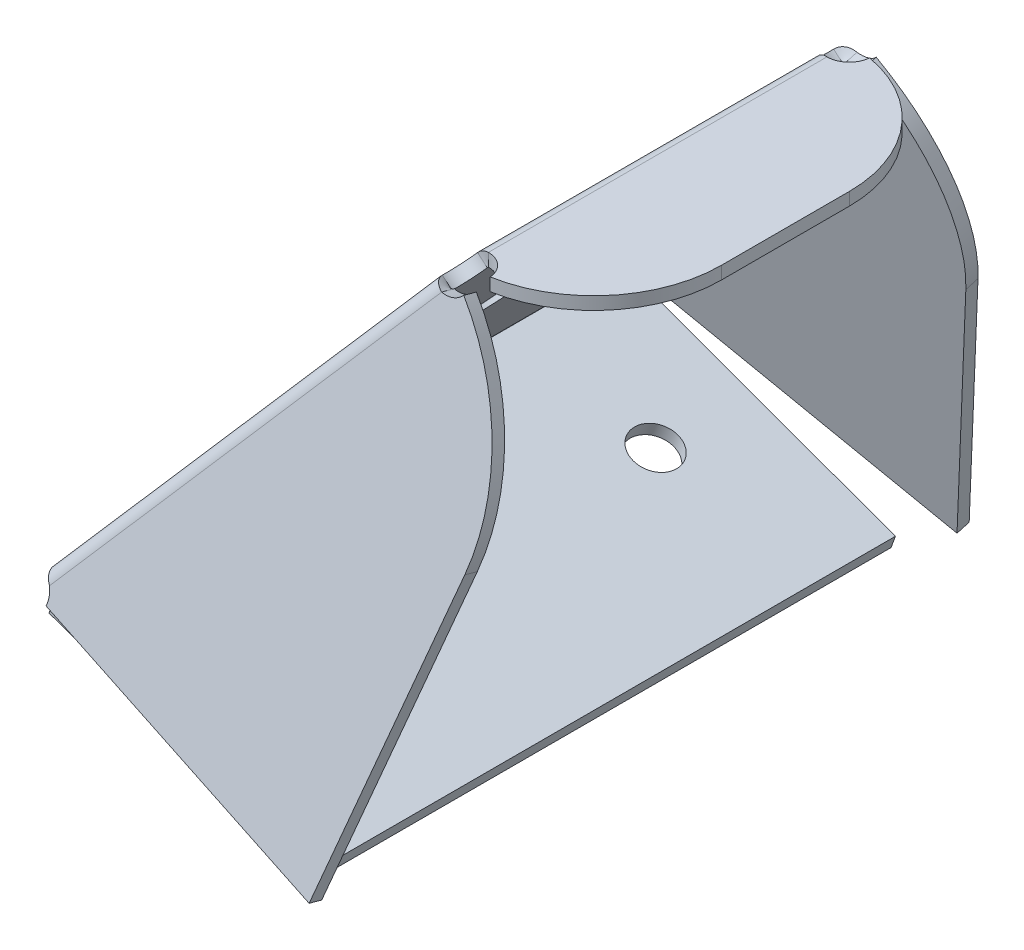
ISO-10303-21;
HEADER;
FILE_DESCRIPTION(('STEP AP214'),'2;1');
FILE_NAME('part.step','',(''),(''),'','','');
FILE_SCHEMA(('AUTOMOTIVE_DESIGN { 1 0 10303 214 1 1 1 1 }'));
ENDSEC;
DATA;
#1=APPLICATION_CONTEXT('core data for automotive mechanical design processes');
#2=APPLICATION_PROTOCOL_DEFINITION('international standard','automotive_design',2000,#1);
#3=PRODUCT_CONTEXT('',#1,'mechanical');
#4=PRODUCT('Part','Part','',(#3));
#5=PRODUCT_RELATED_PRODUCT_CATEGORY('part','',(#4));
#6=PRODUCT_DEFINITION_FORMATION('','',#4);
#7=PRODUCT_DEFINITION_CONTEXT('part definition',#1,'design');
#8=PRODUCT_DEFINITION('design','',#6,#7);
#9=PRODUCT_DEFINITION_SHAPE('','',#8);
#10=(LENGTH_UNIT() NAMED_UNIT(*) SI_UNIT(.MILLI.,.METRE.));
#11=(NAMED_UNIT(*) PLANE_ANGLE_UNIT() SI_UNIT($,.RADIAN.));
#12=(NAMED_UNIT(*) SI_UNIT($,.STERADIAN.) SOLID_ANGLE_UNIT());
#13=UNCERTAINTY_MEASURE_WITH_UNIT(LENGTH_MEASURE(1.E-05),#10,'distance_accuracy_value','');
#14=(GEOMETRIC_REPRESENTATION_CONTEXT(3) GLOBAL_UNCERTAINTY_ASSIGNED_CONTEXT((#13)) GLOBAL_UNIT_ASSIGNED_CONTEXT((#10,
#11,#12)) REPRESENTATION_CONTEXT('',''));
#15=CARTESIAN_POINT('',(0.,0.,0.));
#16=DIRECTION('',(0.,0.,1.));
#17=DIRECTION('',(1.,0.,0.));
#18=AXIS2_PLACEMENT_3D('',#15,#16,#17);
#19=CARTESIAN_POINT('',(63.566206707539,1.03874879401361,-15.0000003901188));
#20=DIRECTION('',(0.766044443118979,-0.642787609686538,0.));
#21=DIRECTION('',(0.,0.,-1.));
#22=AXIS2_PLACEMENT_3D('',#19,#20,#21);
#23=CYLINDRICAL_SURFACE('',#22,1.74999999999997);
#24=CARTESIAN_POINT('',(63.566206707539,1.03874879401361,-15.0000003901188));
#25=DIRECTION('',(0.766044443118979,-0.642787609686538,0.));
#26=DIRECTION('',(0.,0.,1.));
#27=AXIS2_PLACEMENT_3D('',#24,#25,#26);
#28=CIRCLE('',#27,1.74999999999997);
#29=CARTESIAN_POINT('',(63.23095845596,0.639215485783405,-13.3295268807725));
#30=VERTEX_POINT('',#29);
#31=CARTESIAN_POINT('',(62.4596138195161,-0.280037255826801,-15.3142543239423));
#32=VERTEX_POINT('',#31);
#33=EDGE_CURVE('E329',#30,#32,#28,.T.);
#34=ORIENTED_EDGE('',*,*,#33,.F.);
#35=CARTESIAN_POINT('',(63.9970029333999,-0.00357215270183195,-13.3295268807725));
#36=CARTESIAN_POINT('',(63.2309584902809,0.6392154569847,-13.3295268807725));
#37=B_SPLINE_CURVE_WITH_KNOTS('',1,(#35,#36),.UNSPECIFIED.,.F.,.F.,(2,2),(0.,1.),.UNSPECIFIED.);
#38=CARTESIAN_POINT('',(63.9970028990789,-0.00357212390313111,-13.3295268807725));
#39=VERTEX_POINT('',#38);
#40=EDGE_CURVE('E12',#30,#39,#37,.F.);
#41=ORIENTED_EDGE('',*,*,#40,.T.);
#42=CARTESIAN_POINT('',(64.3322511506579,0.395961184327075,-15.0000003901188));
#43=DIRECTION('',(0.766044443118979,-0.642787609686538,0.));
#44=DIRECTION('',(0.,0.,1.));
#45=AXIS2_PLACEMENT_3D('',#42,#43,#44);
#46=CIRCLE('',#45,1.74999999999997);
#47=CARTESIAN_POINT('',(63.2256582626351,-0.922824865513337,-15.3142543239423));
#48=VERTEX_POINT('',#47);
#49=EDGE_CURVE('E118',#39,#48,#46,.T.);
#50=ORIENTED_EDGE('',*,*,#49,.T.);
#51=CARTESIAN_POINT('',(62.4596138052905,-0.280037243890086,-15.3142543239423));
#52=CARTESIAN_POINT('',(63.2256582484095,-0.922824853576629,-15.3142543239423));
#53=B_SPLINE_CURVE_WITH_KNOTS('',1,(#51,#52),.UNSPECIFIED.,.F.,.F.,(2,2),(0.,1.),.UNSPECIFIED.);
#54=EDGE_CURVE('E826',#32,#48,#53,.T.);
#55=ORIENTED_EDGE('',*,*,#54,.F.);
#56=EDGE_LOOP('',(#34,#41,#50,#55));
#57=FACE_BOUND('',#56,.T.);
#58=ADVANCED_FACE('F100',(#57),#23,.F.);
#59=CARTESIAN_POINT('',(63.566206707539,1.03874879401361,15.0000003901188));
#60=DIRECTION('',(0.766044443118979,-0.642787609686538,0.));
#61=DIRECTION('',(0.,0.,-1.));
#62=AXIS2_PLACEMENT_3D('',#59,#60,#61);
#63=CYLINDRICAL_SURFACE('',#62,1.74999999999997);
#64=CARTESIAN_POINT('',(64.3322511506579,0.395961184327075,15.0000003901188));
#65=DIRECTION('',(0.766044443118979,-0.642787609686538,0.));
#66=DIRECTION('',(0.,0.,-1.));
#67=AXIS2_PLACEMENT_3D('',#64,#65,#66);
#68=CIRCLE('',#67,1.74999999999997);
#69=CARTESIAN_POINT('',(63.2256582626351,-0.922824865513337,15.3142543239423));
#70=VERTEX_POINT('',#69);
#71=CARTESIAN_POINT('',(63.9970028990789,-0.00357212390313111,13.3295268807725));
#72=VERTEX_POINT('',#71);
#73=EDGE_CURVE('E125',#70,#72,#68,.T.);
#74=ORIENTED_EDGE('',*,*,#73,.T.);
#75=CARTESIAN_POINT('',(63.2309584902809,0.6392154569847,13.3295268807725));
#76=CARTESIAN_POINT('',(63.9970029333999,-0.00357215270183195,13.3295268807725));
#77=B_SPLINE_CURVE_WITH_KNOTS('',1,(#75,#76),.UNSPECIFIED.,.F.,.F.,(2,2),(0.,1.),.UNSPECIFIED.);
#78=CARTESIAN_POINT('',(63.2309584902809,0.639215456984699,13.3295268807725));
#79=VERTEX_POINT('',#78);
#80=EDGE_CURVE('E309',#72,#79,#77,.F.);
#81=ORIENTED_EDGE('',*,*,#80,.T.);
#82=CARTESIAN_POINT('',(63.566206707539,1.03874879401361,15.0000003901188));
#83=DIRECTION('',(0.766044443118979,-0.642787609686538,0.));
#84=DIRECTION('',(0.,0.,-1.));
#85=AXIS2_PLACEMENT_3D('',#82,#83,#84);
#86=CIRCLE('',#85,1.74999999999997);
#87=CARTESIAN_POINT('',(62.4596138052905,-0.280037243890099,15.3142543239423));
#88=VERTEX_POINT('',#87);
#89=EDGE_CURVE('E312',#88,#79,#86,.T.);
#90=ORIENTED_EDGE('',*,*,#89,.F.);
#91=CARTESIAN_POINT('',(63.2256582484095,-0.922824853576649,15.3142543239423));
#92=CARTESIAN_POINT('',(62.4596138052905,-0.280037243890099,15.3142543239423));
#93=B_SPLINE_CURVE_WITH_KNOTS('',1,(#91,#92),.UNSPECIFIED.,.F.,.F.,(2,2),(0.,1.),.UNSPECIFIED.);
#94=EDGE_CURVE('E342',#70,#88,#93,.T.);
#95=ORIENTED_EDGE('',*,*,#94,.F.);
#96=EDGE_LOOP('',(#74,#81,#90,#95));
#97=FACE_BOUND('',#96,.T.);
#98=ADVANCED_FACE('F311',(#97),#63,.F.);
#99=CARTESIAN_POINT('',(38.620746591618,-30.2458167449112,-22.5));
#100=DIRECTION('',(-0.766044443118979,0.642787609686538,0.));
#101=DIRECTION('',(0.,0.,1.));
#102=AXIS2_PLACEMENT_3D('',#99,#100,#101);
#103=PLANE('',#102);
#104=CARTESIAN_POINT('',(51.4764989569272,-14.9249276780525,0.));
#105=DIRECTION('',(-0.766044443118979,0.642787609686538,0.));
#106=DIRECTION('',(0.,0.,1.));
#107=AXIS2_PLACEMENT_3D('',#104,#105,#106);
#108=CIRCLE('',#107,2.5);
#109=CARTESIAN_POINT('',(51.4764989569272,-14.9249276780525,2.5));
#110=VERTEX_POINT('',#109);
#111=EDGE_CURVE('E952',#110,#110,#108,.T.);
#112=ORIENTED_EDGE('',*,*,#111,.T.);
#113=EDGE_LOOP('',(#112));
#114=FACE_BOUND('',#113,.T.);
#115=ORIENTED_EDGE('',*,*,#49,.F.);
#116=DIRECTION('',(0.,0.,1.));
#117=VECTOR('',#116,1.);
#118=CARTESIAN_POINT('',(63.9970028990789,-0.00357212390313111,-22.5));
#119=LINE('',#118,#117);
#120=EDGE_CURVE('E111',#39,#72,#119,.T.);
#121=ORIENTED_EDGE('',*,*,#120,.T.);
#122=ORIENTED_EDGE('',*,*,#73,.F.);
#123=DIRECTION('',(0.631778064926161,0.752923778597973,-0.184288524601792));
#124=VECTOR('',#123,1.);
#125=CARTESIAN_POINT('',(43.8590777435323,-24.0030167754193,20.9634510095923));
#126=LINE('',#125,#124);
#127=CARTESIAN_POINT('',(39.7253515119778,-28.9293998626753,22.1692515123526));
#128=VERTEX_POINT('',#127);
#129=EDGE_CURVE('E1634',#128,#70,#126,.T.);
#130=ORIENTED_EDGE('',*,*,#129,.F.);
#131=CARTESIAN_POINT('',(38.620746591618,-30.2458167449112,22.5));
#132=DIRECTION('',(0.766044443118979,-0.642787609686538,0.));
#133=DIRECTION('',(0.,0.,-1.));
#134=AXIS2_PLACEMENT_3D('',#131,#132,#133);
#135=CIRCLE('',#134,1.75);
#136=CARTESIAN_POINT('',(38.6299265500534,-30.2348764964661,20.7500582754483));
#137=VERTEX_POINT('',#136);
#138=EDGE_CURVE('E961',#137,#128,#135,.T.);
#139=ORIENTED_EDGE('',*,*,#138,.F.);
#140=DIRECTION('',(0.,0.,-1.));
#141=VECTOR('',#140,1.);
#142=CARTESIAN_POINT('',(38.6299265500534,-30.2348764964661,-22.5));
#143=LINE('',#142,#141);
#144=CARTESIAN_POINT('',(38.6299265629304,-30.2348765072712,-20.7500582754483));
#145=VERTEX_POINT('',#144);
#146=EDGE_CURVE('E960',#137,#145,#143,.T.);
#147=ORIENTED_EDGE('',*,*,#146,.T.);
#148=CARTESIAN_POINT('',(38.620746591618,-30.2458167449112,-22.5));
#149=DIRECTION('',(0.766044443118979,-0.642787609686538,0.));
#150=DIRECTION('',(0.,0.,1.));
#151=AXIS2_PLACEMENT_3D('',#148,#149,#150);
#152=CIRCLE('',#151,1.75);
#153=CARTESIAN_POINT('',(39.7253515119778,-28.9293998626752,-22.1692515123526));
#154=VERTEX_POINT('',#153);
#155=EDGE_CURVE('E967',#154,#145,#152,.T.);
#156=ORIENTED_EDGE('',*,*,#155,.F.);
#157=DIRECTION('',(-0.631778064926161,-0.752923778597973,-0.184288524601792));
#158=VECTOR('',#157,1.);
#159=CARTESIAN_POINT('',(38.6197526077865,-30.2470013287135,-22.4917527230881));
#160=LINE('',#159,#158);
#161=EDGE_CURVE('E1020',#48,#154,#160,.T.);
#162=ORIENTED_EDGE('',*,*,#161,.F.);
#163=EDGE_LOOP('',(#115,#121,#122,#130,#139,#147,#156,#162));
#164=FACE_BOUND('',#163,.T.);
#165=ADVANCED_FACE('F1079',(#114,#164),#103,.F.);
#166=CARTESIAN_POINT('',(37.8547021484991,-29.6030291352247,-22.5));
#167=DIRECTION('',(-0.766044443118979,0.642787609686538,0.));
#168=DIRECTION('',(0.,0.,1.));
#169=AXIS2_PLACEMENT_3D('',#166,#167,#168);
#170=PLANE('',#169);
#171=DIRECTION('',(0.,0.,1.));
#172=VECTOR('',#171,1.);
#173=CARTESIAN_POINT('',(63.23095845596,0.639215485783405,-22.5));
#174=LINE('',#173,#172);
#175=EDGE_CURVE('E319',#30,#79,#174,.T.);
#176=ORIENTED_EDGE('',*,*,#175,.F.);
#177=ORIENTED_EDGE('',*,*,#33,.T.);
#178=DIRECTION('',(-0.631778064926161,-0.752923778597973,-0.184288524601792));
#179=VECTOR('',#178,1.);
#180=CARTESIAN_POINT('',(37.8537081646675,-29.6042137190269,-22.4917527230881));
#181=LINE('',#180,#179);
#182=CARTESIAN_POINT('',(38.9593070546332,-28.286612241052,-22.1692515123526));
#183=VERTEX_POINT('',#182);
#184=EDGE_CURVE('E1793',#32,#183,#181,.T.);
#185=ORIENTED_EDGE('',*,*,#184,.T.);
#186=CARTESIAN_POINT('',(37.8547021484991,-29.6030291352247,-22.5));
#187=DIRECTION('',(0.766044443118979,-0.642787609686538,0.));
#188=DIRECTION('',(0.,0.,1.));
#189=AXIS2_PLACEMENT_3D('',#186,#187,#188);
#190=CIRCLE('',#189,1.75);
#191=CARTESIAN_POINT('',(37.8638821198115,-29.5920888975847,-20.7500582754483));
#192=VERTEX_POINT('',#191);
#193=EDGE_CURVE('E1083',#183,#192,#190,.T.);
#194=ORIENTED_EDGE('',*,*,#193,.T.);
#195=DIRECTION('',(0.,0.,-1.));
#196=VECTOR('',#195,1.);
#197=CARTESIAN_POINT('',(37.8638821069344,-29.5920888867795,-22.5));
#198=LINE('',#197,#196);
#199=CARTESIAN_POINT('',(37.8638821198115,-29.5920888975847,20.7500582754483));
#200=VERTEX_POINT('',#199);
#201=EDGE_CURVE('E965',#200,#192,#198,.T.);
#202=ORIENTED_EDGE('',*,*,#201,.F.);
#203=CARTESIAN_POINT('',(37.8547021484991,-29.6030291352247,22.5));
#204=DIRECTION('',(0.766044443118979,-0.642787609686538,0.));
#205=DIRECTION('',(0.,0.,-1.));
#206=AXIS2_PLACEMENT_3D('',#203,#204,#205);
#207=CIRCLE('',#206,1.75);
#208=CARTESIAN_POINT('',(38.9593070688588,-28.2866122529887,22.1692515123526));
#209=VERTEX_POINT('',#208);
#210=EDGE_CURVE('E330',#200,#209,#207,.T.);
#211=ORIENTED_EDGE('',*,*,#210,.T.);
#212=DIRECTION('',(0.631778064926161,0.752923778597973,-0.184288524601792));
#213=VECTOR('',#212,1.);
#214=CARTESIAN_POINT('',(43.0930333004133,-23.3602291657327,20.9634510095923));
#215=LINE('',#214,#213);
#216=EDGE_CURVE('E327',#209,#88,#215,.T.);
#217=ORIENTED_EDGE('',*,*,#216,.T.);
#218=ORIENTED_EDGE('',*,*,#89,.T.);
#219=EDGE_LOOP('',(#176,#177,#185,#194,#202,#211,#217,#218));
#220=FACE_BOUND('',#219,.T.);
#221=CARTESIAN_POINT('',(50.7104545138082,-14.282140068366,0.));
#222=DIRECTION('',(-0.766044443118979,0.642787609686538,0.));
#223=DIRECTION('',(0.,0.,1.));
#224=AXIS2_PLACEMENT_3D('',#221,#222,#223);
#225=CIRCLE('',#224,2.5);
#226=CARTESIAN_POINT('',(50.7104545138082,-14.282140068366,2.5));
#227=VERTEX_POINT('',#226);
#228=EDGE_CURVE('E962',#227,#227,#225,.T.);
#229=ORIENTED_EDGE('',*,*,#228,.F.);
#230=EDGE_LOOP('',(#229));
#231=FACE_BOUND('',#230,.T.);
#232=ADVANCED_FACE('F323',(#220,#231),#170,.T.);
#233=CARTESIAN_POINT('',(37.2177064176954,-30.7993296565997,-22.5));
#234=DIRECTION('',(-0.342020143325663,-0.93969262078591,0.));
#235=DIRECTION('',(0.,0.,1.));
#236=AXIS2_PLACEMENT_3D('',#233,#234,#235);
#237=PLANE('',#236);
#238=CARTESIAN_POINT('',(48.4940178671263,-34.9035713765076,15.));
#239=DIRECTION('',(-0.342020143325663,-0.93969262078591,0.));
#240=DIRECTION('',(0.,0.,-1.));
#241=AXIS2_PLACEMENT_3D('',#238,#239,#240);
#242=CIRCLE('',#241,1.75);
#243=CARTESIAN_POINT('',(48.4940178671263,-34.9035713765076,13.25));
#244=VERTEX_POINT('',#243);
#245=EDGE_CURVE('E1835',#244,#244,#242,.T.);
#246=ORIENTED_EDGE('',*,*,#245,.F.);
#247=EDGE_LOOP('',(#246));
#248=FACE_BOUND('',#247,.T.);
#249=CARTESIAN_POINT('',(48.4940178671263,-34.9035713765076,-15.));
#250=DIRECTION('',(-0.342020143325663,-0.93969262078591,0.));
#251=DIRECTION('',(0.,0.,1.));
#252=AXIS2_PLACEMENT_3D('',#249,#250,#251);
#253=CIRCLE('',#252,1.75);
#254=CARTESIAN_POINT('',(48.4940178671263,-34.9035713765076,-13.25));
#255=VERTEX_POINT('',#254);
#256=EDGE_CURVE('E1801',#255,#255,#253,.T.);
#257=ORIENTED_EDGE('',*,*,#256,.F.);
#258=EDGE_LOOP('',(#257));
#259=FACE_BOUND('',#258,.T.);
#260=CARTESIAN_POINT('',(37.2177064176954,-30.7993296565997,22.5));
#261=DIRECTION('',(0.342020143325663,0.93969262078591,0.));
#262=DIRECTION('',(0.,0.,-1.));
#263=AXIS2_PLACEMENT_3D('',#260,#261,#262);
#264=CIRCLE('',#263,1.75);
#265=CARTESIAN_POINT('',(38.8621685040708,-31.3978649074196,22.5));
#266=VERTEX_POINT('',#265);
#267=CARTESIAN_POINT('',(38.2921466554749,-31.1903939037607,21.1751804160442));
#268=VERTEX_POINT('',#267);
#269=EDGE_CURVE('E1855',#266,#268,#264,.T.);
#270=ORIENTED_EDGE('',*,*,#269,.T.);
#271=DIRECTION('',(0.,0.,-1.));
#272=VECTOR('',#271,1.);
#273=CARTESIAN_POINT('',(38.2921466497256,-31.1903939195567,-22.5));
#274=LINE('',#273,#272);
#275=CARTESIAN_POINT('',(38.2921466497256,-31.1903939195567,-21.1751804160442));
#276=VERTEX_POINT('',#275);
#277=EDGE_CURVE('E1774',#268,#276,#274,.T.);
#278=ORIENTED_EDGE('',*,*,#277,.T.);
#279=CARTESIAN_POINT('',(37.2177064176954,-30.7993296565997,-22.5));
#280=DIRECTION('',(0.342020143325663,0.93969262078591,0.));
#281=DIRECTION('',(0.,0.,1.));
#282=AXIS2_PLACEMENT_3D('',#279,#280,#281);
#283=CIRCLE('',#282,1.75);
#284=CARTESIAN_POINT('',(38.8621685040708,-31.3978649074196,-22.5));
#285=VERTEX_POINT('',#284);
#286=EDGE_CURVE('E1783',#276,#285,#283,.T.);
#287=ORIENTED_EDGE('',*,*,#286,.T.);
#288=DIRECTION('',(0.93969262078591,-0.342020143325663,0.));
#289=VECTOR('',#288,1.);
#290=CARTESIAN_POINT('',(59.7703293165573,-39.0078130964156,-22.5));
#291=LINE('',#290,#289);
#292=CARTESIAN_POINT('',(59.7703293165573,-39.0078130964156,-22.5));
#293=VERTEX_POINT('',#292);
#294=EDGE_CURVE('E1849',#285,#293,#291,.T.);
#295=ORIENTED_EDGE('',*,*,#294,.T.);
#296=DIRECTION('',(0.,0.,1.));
#297=VECTOR('',#296,1.);
#298=CARTESIAN_POINT('',(59.7703293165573,-39.0078130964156,22.5));
#299=LINE('',#298,#297);
#300=CARTESIAN_POINT('',(59.7703293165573,-39.0078130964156,22.5));
#301=VERTEX_POINT('',#300);
#302=EDGE_CURVE('E1851',#293,#301,#299,.T.);
#303=ORIENTED_EDGE('',*,*,#302,.T.);
#304=DIRECTION('',(-0.93969262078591,0.342020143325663,0.));
#305=VECTOR('',#304,1.);
#306=CARTESIAN_POINT('',(59.7703293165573,-39.0078130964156,22.5));
#307=LINE('',#306,#305);
#308=EDGE_CURVE('E1853',#301,#266,#307,.T.);
#309=ORIENTED_EDGE('',*,*,#308,.T.);
#310=EDGE_LOOP('',(#270,#278,#287,#295,#303,#309));
#311=FACE_BOUND('',#310,.T.);
#312=ADVANCED_FACE('F1490',(#248,#259,#311),#237,.T.);
#313=CARTESIAN_POINT('',(37.5597265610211,-29.8596370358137,-22.5));
#314=DIRECTION('',(-0.342020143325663,-0.93969262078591,0.));
#315=DIRECTION('',(0.,0.,1.));
#316=AXIS2_PLACEMENT_3D('',#313,#314,#315);
#317=PLANE('',#316);
#318=DIRECTION('',(0.,0.,-1.));
#319=VECTOR('',#318,1.);
#320=CARTESIAN_POINT('',(38.6341667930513,-30.2507012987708,-22.5));
#321=LINE('',#320,#319);
#322=CARTESIAN_POINT('',(38.6341667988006,-30.2507012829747,21.1751804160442));
#323=VERTEX_POINT('',#322);
#324=CARTESIAN_POINT('',(38.6341667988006,-30.2507012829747,-21.1751804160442));
#325=VERTEX_POINT('',#324);
#326=EDGE_CURVE('E1773',#323,#325,#321,.T.);
#327=ORIENTED_EDGE('',*,*,#326,.F.);
#328=CARTESIAN_POINT('',(37.5597265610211,-29.8596370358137,22.5));
#329=DIRECTION('',(0.342020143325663,0.93969262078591,0.));
#330=DIRECTION('',(0.,0.,-1.));
#331=AXIS2_PLACEMENT_3D('',#328,#329,#330);
#332=CIRCLE('',#331,1.75);
#333=CARTESIAN_POINT('',(39.2041886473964,-30.4581722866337,22.5));
#334=VERTEX_POINT('',#333);
#335=EDGE_CURVE('E1779',#334,#323,#332,.T.);
#336=ORIENTED_EDGE('',*,*,#335,.F.);
#337=DIRECTION('',(-0.93969262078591,0.342020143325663,0.));
#338=VECTOR('',#337,1.);
#339=CARTESIAN_POINT('',(60.1123494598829,-38.0681204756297,22.5));
#340=LINE('',#339,#338);
#341=CARTESIAN_POINT('',(60.1123494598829,-38.0681204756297,22.5));
#342=VERTEX_POINT('',#341);
#343=EDGE_CURVE('E1784',#342,#334,#340,.T.);
#344=ORIENTED_EDGE('',*,*,#343,.F.);
#345=DIRECTION('',(0.,0.,1.));
#346=VECTOR('',#345,1.);
#347=CARTESIAN_POINT('',(60.1123494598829,-38.0681204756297,22.5));
#348=LINE('',#347,#346);
#349=CARTESIAN_POINT('',(60.1123494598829,-38.0681204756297,-22.5));
#350=VERTEX_POINT('',#349);
#351=EDGE_CURVE('E1846',#350,#342,#348,.T.);
#352=ORIENTED_EDGE('',*,*,#351,.F.);
#353=DIRECTION('',(0.93969262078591,-0.342020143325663,0.));
#354=VECTOR('',#353,1.);
#355=CARTESIAN_POINT('',(60.1123494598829,-38.0681204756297,-22.5));
#356=LINE('',#355,#354);
#357=CARTESIAN_POINT('',(39.2041886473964,-30.4581722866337,-22.5));
#358=VERTEX_POINT('',#357);
#359=EDGE_CURVE('E1800',#358,#350,#356,.T.);
#360=ORIENTED_EDGE('',*,*,#359,.F.);
#361=CARTESIAN_POINT('',(37.5597265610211,-29.8596370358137,-22.5));
#362=DIRECTION('',(0.342020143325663,0.93969262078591,0.));
#363=DIRECTION('',(0.,0.,1.));
#364=AXIS2_PLACEMENT_3D('',#361,#362,#363);
#365=CIRCLE('',#364,1.75);
#366=EDGE_CURVE('E1789',#325,#358,#365,.T.);
#367=ORIENTED_EDGE('',*,*,#366,.F.);
#368=EDGE_LOOP('',(#327,#336,#344,#352,#360,#367));
#369=FACE_BOUND('',#368,.T.);
#370=CARTESIAN_POINT('',(48.836038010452,-33.9638787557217,15.));
#371=DIRECTION('',(-0.342020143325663,-0.93969262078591,0.));
#372=DIRECTION('',(0.,0.,-1.));
#373=AXIS2_PLACEMENT_3D('',#370,#371,#372);
#374=CIRCLE('',#373,1.75);
#375=CARTESIAN_POINT('',(48.836038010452,-33.9638787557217,13.25));
#376=VERTEX_POINT('',#375);
#377=EDGE_CURVE('E995',#376,#376,#374,.T.);
#378=ORIENTED_EDGE('',*,*,#377,.T.);
#379=EDGE_LOOP('',(#378));
#380=FACE_BOUND('',#379,.T.);
#381=CARTESIAN_POINT('',(48.836038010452,-33.9638787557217,-15.));
#382=DIRECTION('',(-0.342020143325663,-0.93969262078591,0.));
#383=DIRECTION('',(0.,0.,1.));
#384=AXIS2_PLACEMENT_3D('',#381,#382,#383);
#385=CIRCLE('',#384,1.75);
#386=CARTESIAN_POINT('',(48.836038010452,-33.9638787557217,-13.25));
#387=VERTEX_POINT('',#386);
#388=EDGE_CURVE('E1838',#387,#387,#385,.T.);
#389=ORIENTED_EDGE('',*,*,#388,.T.);
#390=EDGE_LOOP('',(#389));
#391=FACE_BOUND('',#390,.T.);
#392=ADVANCED_FACE('F1481',(#369,#380,#391),#317,.F.);
#393=CARTESIAN_POINT('',(37.2177064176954,-30.7993296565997,-22.5));
#394=DIRECTION('',(0.342020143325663,0.93969262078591,0.));
#395=DIRECTION('',(0.,0.,-1.));
#396=AXIS2_PLACEMENT_3D('',#393,#394,#395);
#397=CYLINDRICAL_SURFACE('',#396,1.75);
#398=CARTESIAN_POINT('',(38.6341667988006,-30.2507012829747,-21.1751804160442));
#399=CARTESIAN_POINT('',(38.2921466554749,-31.1903939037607,-21.1751804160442));
#400=B_SPLINE_CURVE_WITH_KNOTS('',1,(#398,#399),.UNSPECIFIED.,.F.,.F.,(2,2),(0.,1.),.UNSPECIFIED.);
#401=EDGE_CURVE('E1791',#325,#276,#400,.T.);
#402=ORIENTED_EDGE('',*,*,#401,.F.);
#403=ORIENTED_EDGE('',*,*,#366,.T.);
#404=DIRECTION('',(0.342020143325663,0.93969262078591,0.));
#405=VECTOR('',#404,1.);
#406=CARTESIAN_POINT('',(38.8621685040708,-31.3978649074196,-22.5));
#407=LINE('',#406,#405);
#408=EDGE_CURVE('E1863',#285,#358,#407,.T.);
#409=ORIENTED_EDGE('',*,*,#408,.F.);
#410=ORIENTED_EDGE('',*,*,#286,.F.);
#411=EDGE_LOOP('',(#402,#403,#409,#410));
#412=FACE_BOUND('',#411,.T.);
#413=ADVANCED_FACE('F1008',(#412),#397,.F.);
#414=CARTESIAN_POINT('',(59.7703293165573,-39.0078130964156,-22.5));
#415=DIRECTION('',(0.,0.,1.));
#416=DIRECTION('',(-0.93969262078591,0.342020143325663,0.));
#417=AXIS2_PLACEMENT_3D('',#414,#415,#416);
#418=PLANE('',#417);
#419=ORIENTED_EDGE('',*,*,#359,.T.);
#420=DIRECTION('',(0.342020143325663,0.93969262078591,0.));
#421=VECTOR('',#420,1.);
#422=CARTESIAN_POINT('',(59.7703293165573,-39.0078130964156,-22.5));
#423=LINE('',#422,#421);
#424=EDGE_CURVE('E1860',#293,#350,#423,.T.);
#425=ORIENTED_EDGE('',*,*,#424,.F.);
#426=ORIENTED_EDGE('',*,*,#294,.F.);
#427=ORIENTED_EDGE('',*,*,#408,.T.);
#428=EDGE_LOOP('',(#419,#425,#426,#427));
#429=FACE_BOUND('',#428,.T.);
#430=ADVANCED_FACE('F1460',(#429),#418,.F.);
#431=CARTESIAN_POINT('',(59.7703293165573,-39.0078130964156,22.5));
#432=DIRECTION('',(-0.93969262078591,0.342020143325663,0.));
#433=DIRECTION('',(0.,0.,-1.));
#434=AXIS2_PLACEMENT_3D('',#431,#432,#433);
#435=PLANE('',#434);
#436=ORIENTED_EDGE('',*,*,#351,.T.);
#437=DIRECTION('',(0.342020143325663,0.93969262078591,0.));
#438=VECTOR('',#437,1.);
#439=CARTESIAN_POINT('',(59.7703293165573,-39.0078130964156,22.5));
#440=LINE('',#439,#438);
#441=EDGE_CURVE('E1857',#301,#342,#440,.T.);
#442=ORIENTED_EDGE('',*,*,#441,.F.);
#443=ORIENTED_EDGE('',*,*,#302,.F.);
#444=ORIENTED_EDGE('',*,*,#424,.T.);
#445=EDGE_LOOP('',(#436,#442,#443,#444));
#446=FACE_BOUND('',#445,.T.);
#447=ADVANCED_FACE('F1449',(#446),#435,.F.);
#448=CARTESIAN_POINT('',(59.7703293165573,-39.0078130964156,22.5));
#449=DIRECTION('',(0.,0.,-1.));
#450=DIRECTION('',(0.93969262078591,-0.342020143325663,0.));
#451=AXIS2_PLACEMENT_3D('',#448,#449,#450);
#452=PLANE('',#451);
#453=ORIENTED_EDGE('',*,*,#343,.T.);
#454=DIRECTION('',(0.342020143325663,0.93969262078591,0.));
#455=VECTOR('',#454,1.);
#456=CARTESIAN_POINT('',(38.8621685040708,-31.3978649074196,22.5));
#457=LINE('',#456,#455);
#458=EDGE_CURVE('E1781',#266,#334,#457,.T.);
#459=ORIENTED_EDGE('',*,*,#458,.F.);
#460=ORIENTED_EDGE('',*,*,#308,.F.);
#461=ORIENTED_EDGE('',*,*,#441,.T.);
#462=EDGE_LOOP('',(#453,#459,#460,#461));
#463=FACE_BOUND('',#462,.T.);
#464=ADVANCED_FACE('F1438',(#463),#452,.F.);
#465=CARTESIAN_POINT('',(37.2177064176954,-30.7993296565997,22.5));
#466=DIRECTION('',(0.342020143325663,0.93969262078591,0.));
#467=DIRECTION('',(0.,0.,-1.));
#468=AXIS2_PLACEMENT_3D('',#465,#466,#467);
#469=CYLINDRICAL_SURFACE('',#468,1.75);
#470=CARTESIAN_POINT('',(38.2921466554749,-31.1903939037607,21.1751804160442));
#471=CARTESIAN_POINT('',(38.6341667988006,-30.2507012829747,21.1751804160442));
#472=B_SPLINE_CURVE_WITH_KNOTS('',1,(#470,#471),.UNSPECIFIED.,.F.,.F.,(2,2),(0.,1.),.UNSPECIFIED.);
#473=EDGE_CURVE('E1762',#268,#323,#472,.T.);
#474=ORIENTED_EDGE('',*,*,#473,.F.);
#475=ORIENTED_EDGE('',*,*,#269,.F.);
#476=ORIENTED_EDGE('',*,*,#458,.T.);
#477=ORIENTED_EDGE('',*,*,#335,.T.);
#478=EDGE_LOOP('',(#474,#475,#476,#477));
#479=FACE_BOUND('',#478,.T.);
#480=ADVANCED_FACE('F1427',(#479),#469,.F.);
#481=CARTESIAN_POINT('',(48.4940178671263,-34.9035713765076,-15.));
#482=DIRECTION('',(0.342020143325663,0.93969262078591,0.));
#483=DIRECTION('',(0.,0.,-1.));
#484=AXIS2_PLACEMENT_3D('',#481,#482,#483);
#485=CYLINDRICAL_SURFACE('',#484,1.75);
#486=ORIENTED_EDGE('',*,*,#256,.T.);
#487=EDGE_LOOP('',(#486));
#488=FACE_BOUND('',#487,.T.);
#489=ORIENTED_EDGE('',*,*,#388,.F.);
#490=EDGE_LOOP('',(#489));
#491=FACE_BOUND('',#490,.T.);
#492=ADVANCED_FACE('F1417',(#488,#491),#485,.F.);
#493=CARTESIAN_POINT('',(48.4940178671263,-34.9035713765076,15.));
#494=DIRECTION('',(0.342020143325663,0.93969262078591,0.));
#495=DIRECTION('',(0.,0.,-1.));
#496=AXIS2_PLACEMENT_3D('',#493,#494,#495);
#497=CYLINDRICAL_SURFACE('',#496,1.75);
#498=ORIENTED_EDGE('',*,*,#245,.T.);
#499=EDGE_LOOP('',(#498));
#500=FACE_BOUND('',#499,.T.);
#501=ORIENTED_EDGE('',*,*,#377,.F.);
#502=EDGE_LOOP('',(#501));
#503=FACE_BOUND('',#502,.T.);
#504=ADVANCED_FACE('F1408',(#500,#503),#497,.F.);
#505=CARTESIAN_POINT('',(50.7104545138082,-14.282140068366,0.));
#506=DIRECTION('',(0.766044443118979,-0.642787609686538,0.));
#507=DIRECTION('',(0.,0.,-1.));
#508=AXIS2_PLACEMENT_3D('',#505,#506,#507);
#509=CYLINDRICAL_SURFACE('',#508,2.5);
#510=ORIENTED_EDGE('',*,*,#228,.T.);
#511=EDGE_LOOP('',(#510));
#512=FACE_BOUND('',#511,.T.);
#513=ORIENTED_EDGE('',*,*,#111,.F.);
#514=EDGE_LOOP('',(#513));
#515=FACE_BOUND('',#514,.T.);
#516=ADVANCED_FACE('F923',(#512,#515),#509,.F.);
#517=CARTESIAN_POINT('',(37.8547021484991,-29.6030291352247,22.5));
#518=DIRECTION('',(0.766044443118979,-0.642787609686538,0.));
#519=DIRECTION('',(0.,0.,-1.));
#520=AXIS2_PLACEMENT_3D('',#517,#518,#519);
#521=CYLINDRICAL_SURFACE('',#520,1.75);
#522=CARTESIAN_POINT('',(38.9593070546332,-28.286612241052,22.1692515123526));
#523=CARTESIAN_POINT('',(39.7253514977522,-28.9293998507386,22.1692515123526));
#524=B_SPLINE_CURVE_WITH_KNOTS('',1,(#522,#523),.UNSPECIFIED.,.F.,.F.,(2,2),(0.,1.),.UNSPECIFIED.);
#525=EDGE_CURVE('E661',#209,#128,#524,.T.);
#526=ORIENTED_EDGE('',*,*,#525,.F.);
#527=ORIENTED_EDGE('',*,*,#210,.F.);
#528=CARTESIAN_POINT('',(38.6299265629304,-30.2348765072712,20.7500582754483));
#529=CARTESIAN_POINT('',(37.8638821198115,-29.5920888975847,20.7500582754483));
#530=B_SPLINE_CURVE_WITH_KNOTS('',1,(#528,#529),.UNSPECIFIED.,.F.,.F.,(2,2),(0.,1.),.UNSPECIFIED.);
#531=EDGE_CURVE('E972',#200,#137,#530,.F.);
#532=ORIENTED_EDGE('',*,*,#531,.T.);
#533=ORIENTED_EDGE('',*,*,#138,.T.);
#534=EDGE_LOOP('',(#526,#527,#532,#533));
#535=FACE_BOUND('',#534,.T.);
#536=ADVANCED_FACE('F1007',(#535),#521,.F.);
#537=CARTESIAN_POINT('',(37.8547021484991,-29.6030291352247,-22.5));
#538=DIRECTION('',(0.766044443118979,-0.642787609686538,0.));
#539=DIRECTION('',(0.,0.,-1.));
#540=AXIS2_PLACEMENT_3D('',#537,#538,#539);
#541=CYLINDRICAL_SURFACE('',#540,1.75);
#542=CARTESIAN_POINT('',(39.7253514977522,-28.9293998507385,-22.1692515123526));
#543=CARTESIAN_POINT('',(38.9593070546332,-28.286612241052,-22.1692515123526));
#544=B_SPLINE_CURVE_WITH_KNOTS('',1,(#542,#543),.UNSPECIFIED.,.F.,.F.,(2,2),(0.,1.),.UNSPECIFIED.);
#545=EDGE_CURVE('E841',#154,#183,#544,.T.);
#546=ORIENTED_EDGE('',*,*,#545,.F.);
#547=ORIENTED_EDGE('',*,*,#155,.T.);
#548=CARTESIAN_POINT('',(37.8638821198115,-29.5920888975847,-20.7500582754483));
#549=CARTESIAN_POINT('',(38.6299265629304,-30.2348765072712,-20.7500582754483));
#550=B_SPLINE_CURVE_WITH_KNOTS('',1,(#548,#549),.UNSPECIFIED.,.F.,.F.,(2,2),(0.,1.),.UNSPECIFIED.);
#551=EDGE_CURVE('E948',#145,#192,#550,.F.);
#552=ORIENTED_EDGE('',*,*,#551,.T.);
#553=ORIENTED_EDGE('',*,*,#193,.F.);
#554=EDGE_LOOP('',(#546,#547,#552,#553));
#555=FACE_BOUND('',#554,.T.);
#556=ADVANCED_FACE('F997',(#555),#541,.F.);
#557=CARTESIAN_POINT('',(38.2921466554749,-31.1903939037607,21.1751804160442));
#558=CARTESIAN_POINT('',(38.1232803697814,-31.1289316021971,21.1076373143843));
#559=CARTESIAN_POINT('',(37.9765183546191,-31.0237120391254,21.0483027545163));
#560=CARTESIAN_POINT('',(37.7563021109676,-30.763329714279,20.9454353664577));
#561=CARTESIAN_POINT('',(37.6830195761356,-30.6087439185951,20.9020050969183));
#562=CARTESIAN_POINT('',(37.6160289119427,-30.2925865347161,20.8311514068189));
#563=CARTESIAN_POINT('',(37.6220537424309,-30.1313069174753,20.8037279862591));
#564=CARTESIAN_POINT('',(37.6999336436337,-29.8360718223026,20.764887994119));
#565=CARTESIAN_POINT('',(37.7715598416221,-29.7021143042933,20.7534686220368));
#566=CARTESIAN_POINT('',(37.8638821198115,-29.5920888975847,20.7500582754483));
#567=CARTESIAN_POINT('',(38.6341667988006,-30.2507012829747,21.1751804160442));
#568=CARTESIAN_POINT('',(38.6324973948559,-30.2500936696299,21.1077397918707));
#569=CARTESIAN_POINT('',(38.63104177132,-30.24905097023,21.0483027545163));
#570=CARTESIAN_POINT('',(38.6288614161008,-30.2464729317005,20.9454353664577));
#571=CARTESIAN_POINT('',(38.6281358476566,-30.2449423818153,20.9020050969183));
#572=CARTESIAN_POINT('',(38.6274725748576,-30.2418121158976,20.8311514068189));
#573=CARTESIAN_POINT('',(38.6275322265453,-30.2402152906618,20.8037279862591));
#574=CARTESIAN_POINT('',(38.6283033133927,-30.2372921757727,20.764887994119));
#575=CARTESIAN_POINT('',(38.6290118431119,-30.2359666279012,20.7534710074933));
#576=CARTESIAN_POINT('',(38.6299265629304,-30.2348765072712,20.7500582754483));
#577=B_SPLINE_SURFACE_WITH_KNOTS('',1,3,((#557,#558,#559,#560,#561,#562,#563,#564,#565,#566),
(#567,#568,#569,#570,#571,#572,#573,#574,#575,#576)),.UNSPECIFIED.,.F.,.F.,.F.,(2,2),(4,2,2,2,
4),(0.,1.),(0.,0.25,0.5,0.75,1.),.UNSPECIFIED.);
#578=CARTESIAN_POINT('',(38.6341667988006,-30.2507012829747,21.1751804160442));
#579=CARTESIAN_POINT('',(38.6324973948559,-30.2500936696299,21.1077397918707));
#580=CARTESIAN_POINT('',(38.63104177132,-30.24905097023,21.0483027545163));
#581=CARTESIAN_POINT('',(38.6288614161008,-30.2464729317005,20.9454353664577));
#582=CARTESIAN_POINT('',(38.6281358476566,-30.2449423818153,20.9020050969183));
#583=CARTESIAN_POINT('',(38.6274725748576,-30.2418121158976,20.8311514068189));
#584=CARTESIAN_POINT('',(38.6275322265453,-30.2402152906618,20.8037279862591));
#585=CARTESIAN_POINT('',(38.6283033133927,-30.2372921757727,20.764887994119));
#586=CARTESIAN_POINT('',(38.6290118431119,-30.2359666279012,20.7534710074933));
#587=CARTESIAN_POINT('',(38.6299265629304,-30.2348765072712,20.7500582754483));
#588=B_SPLINE_CURVE_WITH_KNOTS('',3,(#578,#579,#580,#581,#582,#583,#584,#585,#586,#587),
.UNSPECIFIED.,.F.,.F.,(4,2,2,2,4),(0.,0.25,0.5,0.75,1.),.UNSPECIFIED.);
#589=EDGE_CURVE('E1734',#323,#137,#588,.T.);
#590=CARTESIAN_POINT('',(37.8638821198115,-29.5920888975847,20.7500582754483));
#591=CARTESIAN_POINT('',(37.7715598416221,-29.7021143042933,20.7534686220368));
#592=CARTESIAN_POINT('',(37.6999336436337,-29.8360718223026,20.764887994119));
#593=CARTESIAN_POINT('',(37.6220537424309,-30.1313069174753,20.8037279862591));
#594=CARTESIAN_POINT('',(37.6160289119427,-30.2925865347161,20.8311514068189));
#595=CARTESIAN_POINT('',(37.6830195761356,-30.6087439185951,20.9020050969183));
#596=CARTESIAN_POINT('',(37.7563021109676,-30.763329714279,20.9454353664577));
#597=CARTESIAN_POINT('',(37.9765183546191,-31.0237120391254,21.0483027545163));
#598=CARTESIAN_POINT('',(38.1232803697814,-31.1289316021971,21.1076373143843));
#599=CARTESIAN_POINT('',(38.2921466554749,-31.1903939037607,21.1751804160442));
#600=B_SPLINE_CURVE_WITH_KNOTS('',3,(#590,#591,#592,#593,#594,#595,#596,#597,#598,#599),
.UNSPECIFIED.,.F.,.F.,(4,2,2,2,4),(0.,0.25,0.5,0.75,1.),.UNSPECIFIED.);
#601=EDGE_CURVE('E1735',#268,#200,#600,.F.);
#602=ORIENTED_EDGE('',*,*,#473,.T.);
#603=ORIENTED_EDGE('',*,*,#589,.T.);
#604=ORIENTED_EDGE('',*,*,#531,.F.);
#605=ORIENTED_EDGE('',*,*,#601,.F.);
#606=EDGE_LOOP('',(#602,#603,#604,#605));
#607=FACE_BOUND('',#606,.T.);
#608=ADVANCED_FACE('F866',(#607),#577,.T.);
#609=CARTESIAN_POINT('',(37.8638821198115,-29.5920888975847,-20.7500582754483));
#610=CARTESIAN_POINT('',(37.7735287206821,-29.6997678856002,-20.759944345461));
#611=CARTESIAN_POINT('',(37.7146880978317,-29.8152175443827,-20.769609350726));
#612=CARTESIAN_POINT('',(37.6425813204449,-30.0333234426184,-20.788639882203));
#613=CARTESIAN_POINT('',(37.6291275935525,-30.1358626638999,-20.7979816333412));
#614=CARTESIAN_POINT('',(37.6262987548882,-30.3148190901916,-20.8163181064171));
#615=CARTESIAN_POINT('',(37.6367560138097,-30.391466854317,-20.8253128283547));
#616=CARTESIAN_POINT('',(37.6570247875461,-30.4854878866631,-20.8385446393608));
#617=CARTESIAN_POINT('',(37.6645883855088,-30.5133982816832,-20.8429118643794));
#618=CARTESIAN_POINT('',(37.6796972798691,-30.5625654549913,-20.8515595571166));
#619=CARTESIAN_POINT('',(37.6868929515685,-30.5829111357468,-20.8556256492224));
#620=CARTESIAN_POINT('',(37.7232340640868,-30.6779835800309,-20.8778829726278));
#621=CARTESIAN_POINT('',(37.7723054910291,-30.7818420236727,-20.9130445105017));
#622=CARTESIAN_POINT('',(37.9581377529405,-31.002383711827,-21.0180789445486));
#623=CARTESIAN_POINT('',(38.0964515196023,-31.1191666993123,-21.0874109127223));
#624=CARTESIAN_POINT('',(38.2921466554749,-31.1903939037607,-21.1751804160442));
#625=CARTESIAN_POINT('',(38.6299265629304,-30.2348765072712,-20.7500582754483));
#626=CARTESIAN_POINT('',(38.6290340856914,-30.2359401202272,-20.7599210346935));
#627=CARTESIAN_POINT('',(38.6284493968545,-30.2370856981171,-20.769609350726));
#628=CARTESIAN_POINT('',(38.6277354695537,-30.239245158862,-20.788639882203));
#629=CARTESIAN_POINT('',(38.6276022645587,-30.240260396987,-20.7979816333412));
#630=CARTESIAN_POINT('',(38.6275742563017,-30.2420322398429,-20.8163181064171));
#631=CARTESIAN_POINT('',(38.6276777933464,-30.2427911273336,-20.8253128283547));
#632=CARTESIAN_POINT('',(38.6278784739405,-30.2437220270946,-20.8385446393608));
#633=CARTESIAN_POINT('',(38.6279533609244,-30.2439983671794,-20.8429118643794));
#634=CARTESIAN_POINT('',(38.6281029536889,-30.2444851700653,-20.8515595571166));
#635=CARTESIAN_POINT('',(38.6281741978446,-30.2446866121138,-20.8556256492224));
#636=CARTESIAN_POINT('',(38.6285340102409,-30.2456279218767,-20.8778829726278));
#637=CARTESIAN_POINT('',(38.6290198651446,-30.2466562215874,-20.9130445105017));
#638=CARTESIAN_POINT('',(38.6308597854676,-30.248839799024,-21.0180789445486));
#639=CARTESIAN_POINT('',(38.632241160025,-30.2500004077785,-21.087951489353));
#640=CARTESIAN_POINT('',(38.6341667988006,-30.2507012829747,-21.1751804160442));
#641=B_SPLINE_SURFACE_WITH_KNOTS('',1,3,((#609,#610,#611,#612,#613,#614,#615,#616,#617,#618,
#619,#620,#621,#622,#623,#624),(#625,#626,#627,#628,#629,#630,#631,#632,#633,#634,#635,#636,
#637,#638,#639,#640)),.UNSPECIFIED.,.F.,.F.,.F.,(2,2),(4,2,2,2,2,2,2,4),(0.,1.),(0.,0.125,0.25,
0.375,0.4375,0.5,0.75,1.),.UNSPECIFIED.);
#642=CARTESIAN_POINT('',(38.6299265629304,-30.2348765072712,-20.7500582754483));
#643=CARTESIAN_POINT('',(38.6290340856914,-30.2359401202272,-20.7599210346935));
#644=CARTESIAN_POINT('',(38.6284493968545,-30.2370856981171,-20.769609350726));
#645=CARTESIAN_POINT('',(38.6277354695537,-30.239245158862,-20.788639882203));
#646=CARTESIAN_POINT('',(38.6276022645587,-30.240260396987,-20.7979816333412));
#647=CARTESIAN_POINT('',(38.6275742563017,-30.2420322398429,-20.8163181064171));
#648=CARTESIAN_POINT('',(38.6276777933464,-30.2427911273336,-20.8253128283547));
#649=CARTESIAN_POINT('',(38.6278784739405,-30.2437220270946,-20.8385446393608));
#650=CARTESIAN_POINT('',(38.6279533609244,-30.2439983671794,-20.8429118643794));
#651=CARTESIAN_POINT('',(38.6281029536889,-30.2444851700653,-20.8515595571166));
#652=CARTESIAN_POINT('',(38.6281741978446,-30.2446866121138,-20.8556256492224));
#653=CARTESIAN_POINT('',(38.6285340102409,-30.2456279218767,-20.8778829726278));
#654=CARTESIAN_POINT('',(38.6290198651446,-30.2466562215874,-20.9130445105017));
#655=CARTESIAN_POINT('',(38.6308597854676,-30.248839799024,-21.0180789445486));
#656=CARTESIAN_POINT('',(38.632241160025,-30.2500004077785,-21.087951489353));
#657=CARTESIAN_POINT('',(38.6341667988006,-30.2507012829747,-21.1751804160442));
#658=B_SPLINE_CURVE_WITH_KNOTS('',3,(#642,#643,#644,#645,#646,#647,#648,#649,#650,#651,#652,
#653,#654,#655,#656,#657),.UNSPECIFIED.,.F.,.F.,(4,2,2,2,2,2,2,4),(0.,0.125,0.25,0.375,0.4375,
0.5,0.75,1.),.UNSPECIFIED.);
#659=EDGE_CURVE('E895',#145,#325,#658,.T.);
#660=CARTESIAN_POINT('',(38.2921466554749,-31.1903939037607,-21.1751804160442));
#661=CARTESIAN_POINT('',(38.0964515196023,-31.1191666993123,-21.0874109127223));
#662=CARTESIAN_POINT('',(37.9581377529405,-31.002383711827,-21.0180789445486));
#663=CARTESIAN_POINT('',(37.7723054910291,-30.7818420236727,-20.9130445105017));
#664=CARTESIAN_POINT('',(37.7232340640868,-30.6779835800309,-20.8778829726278));
#665=CARTESIAN_POINT('',(37.6868929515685,-30.5829111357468,-20.8556256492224));
#666=CARTESIAN_POINT('',(37.6796972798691,-30.5625654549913,-20.8515595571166));
#667=CARTESIAN_POINT('',(37.6645883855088,-30.5133982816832,-20.8429118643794));
#668=CARTESIAN_POINT('',(37.6570247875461,-30.4854878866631,-20.8385446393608));
#669=CARTESIAN_POINT('',(37.6367560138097,-30.391466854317,-20.8253128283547));
#670=CARTESIAN_POINT('',(37.6262987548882,-30.3148190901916,-20.8163181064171));
#671=CARTESIAN_POINT('',(37.6291275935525,-30.1358626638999,-20.7979816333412));
#672=CARTESIAN_POINT('',(37.6425813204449,-30.0333234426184,-20.788639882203));
#673=CARTESIAN_POINT('',(37.7146880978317,-29.8152175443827,-20.769609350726));
#674=CARTESIAN_POINT('',(37.7735287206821,-29.6997678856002,-20.759944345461));
#675=CARTESIAN_POINT('',(37.8638821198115,-29.5920888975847,-20.7500582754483));
#676=B_SPLINE_CURVE_WITH_KNOTS('',3,(#660,#661,#662,#663,#664,#665,#666,#667,#668,#669,#670,
#671,#672,#673,#674,#675),.UNSPECIFIED.,.F.,.F.,(4,2,2,2,2,2,2,4),(0.,0.25,0.5,0.5625,0.625,
0.75,0.875,1.),.UNSPECIFIED.);
#677=EDGE_CURVE('E888',#192,#276,#676,.F.);
#678=ORIENTED_EDGE('',*,*,#659,.T.);
#679=ORIENTED_EDGE('',*,*,#401,.T.);
#680=ORIENTED_EDGE('',*,*,#677,.F.);
#681=ORIENTED_EDGE('',*,*,#551,.F.);
#682=EDGE_LOOP('',(#678,#679,#680,#681));
#683=FACE_BOUND('',#682,.T.);
#684=ADVANCED_FACE('F864',(#683),#641,.T.);
#685=CARTESIAN_POINT('',(38.6375869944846,-30.241304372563,-42.3779810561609));
#686=DIRECTION('',(0.,0.,1.));
#687=DIRECTION('',(0.642787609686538,0.766044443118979,0.));
#688=AXIS2_PLACEMENT_3D('',#685,#686,#687);
#689=CYLINDRICAL_SURFACE('',#688,1.00999998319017);
#690=ORIENTED_EDGE('',*,*,#201,.T.);
#691=ORIENTED_EDGE('',*,*,#677,.T.);
#692=ORIENTED_EDGE('',*,*,#277,.F.);
#693=ORIENTED_EDGE('',*,*,#601,.T.);
#694=EDGE_LOOP('',(#690,#691,#692,#693));
#695=FACE_BOUND('',#694,.T.);
#696=ADVANCED_FACE('F855',(#695),#689,.T.);
#697=CARTESIAN_POINT('',(38.6375869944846,-30.241304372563,-42.3779810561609));
#698=DIRECTION('',(0.,0.,1.));
#699=DIRECTION('',(0.642787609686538,0.766044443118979,0.));
#700=AXIS2_PLACEMENT_3D('',#697,#698,#699);
#701=CYLINDRICAL_SURFACE('',#700,0.00999998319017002);
#702=ORIENTED_EDGE('',*,*,#146,.F.);
#703=ORIENTED_EDGE('',*,*,#589,.F.);
#704=ORIENTED_EDGE('',*,*,#326,.T.);
#705=ORIENTED_EDGE('',*,*,#659,.F.);
#706=EDGE_LOOP('',(#702,#703,#704,#705));
#707=FACE_BOUND('',#706,.T.);
#708=ADVANCED_FACE('F799',(#707),#701,.F.);
#709=CARTESIAN_POINT('',(62.4596138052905,-0.280037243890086,-15.3142543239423));
#710=CARTESIAN_POINT('',(62.4871546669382,-0.247215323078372,-15.4736161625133));
#711=CARTESIAN_POINT('',(62.5445578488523,-0.241303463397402,-15.6191575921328));
#712=CARTESIAN_POINT('',(62.6880612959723,-0.261910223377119,-15.8624457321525));
#713=CARTESIAN_POINT('',(62.773800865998,-0.288187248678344,-15.9601386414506));
#714=CARTESIAN_POINT('',(62.9483400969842,-0.351575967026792,-16.1084635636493));
#715=CARTESIAN_POINT('',(63.0371355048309,-0.388590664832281,-16.1594772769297));
#716=CARTESIAN_POINT('',(63.2034264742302,-0.458181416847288,-16.2276152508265));
#717=CARTESIAN_POINT('',(63.2811567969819,-0.490841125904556,-16.2449896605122));
#718=CARTESIAN_POINT('',(63.3502557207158,-0.517042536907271,-16.2529426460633));
#719=CARTESIAN_POINT('',(63.2256582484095,-0.922824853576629,-15.3142543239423));
#720=CARTESIAN_POINT('',(63.233879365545,-0.913027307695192,-15.3135090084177));
#721=CARTESIAN_POINT('',(63.2431627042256,-0.902582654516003,-15.3124124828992));
#722=CARTESIAN_POINT('',(63.2635442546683,-0.880190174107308,-15.3092904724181));
#723=CARTESIAN_POINT('',(63.2746392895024,-0.868239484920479,-15.3072689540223));
#724=CARTESIAN_POINT('',(63.2983911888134,-0.842620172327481,-15.3023132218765));
#725=CARTESIAN_POINT('',(63.3110480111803,-0.828950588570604,-15.2993827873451));
#726=CARTESIAN_POINT('',(63.3377813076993,-0.799742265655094,-15.2927396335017));
#727=CARTESIAN_POINT('',(63.351858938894,-0.784203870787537,-15.2890292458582));
#728=CARTESIAN_POINT('',(63.3666192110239,-0.7676898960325,-15.2850024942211));
#729=B_SPLINE_SURFACE_WITH_KNOTS('',1,3,((#709,#710,#711,#712,#713,#714,#715,#716,#717,#718),
(#719,#720,#721,#722,#723,#724,#725,#726,#727,#728)),.UNSPECIFIED.,.F.,.F.,.F.,(2,2),(4,2,2,2,
4),(0.,1.),(0.,0.25,0.5,0.75,1.),.UNSPECIFIED.);
#730=CARTESIAN_POINT('',(63.2256582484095,-0.922824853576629,-15.3142543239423));
#731=CARTESIAN_POINT('',(63.233879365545,-0.913027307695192,-15.3135090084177));
#732=CARTESIAN_POINT('',(63.2431627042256,-0.902582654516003,-15.3124124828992));
#733=CARTESIAN_POINT('',(63.2635442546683,-0.880190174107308,-15.3092904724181));
#734=CARTESIAN_POINT('',(63.2746392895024,-0.868239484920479,-15.3072689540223));
#735=CARTESIAN_POINT('',(63.2983911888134,-0.842620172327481,-15.3023132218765));
#736=CARTESIAN_POINT('',(63.3110480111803,-0.828950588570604,-15.2993827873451));
#737=CARTESIAN_POINT('',(63.3377813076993,-0.799742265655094,-15.2927396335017));
#738=CARTESIAN_POINT('',(63.351858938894,-0.784203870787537,-15.2890292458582));
#739=CARTESIAN_POINT('',(63.3666192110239,-0.7676898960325,-15.2850024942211));
#740=B_SPLINE_CURVE_WITH_KNOTS('',3,(#730,#731,#732,#733,#734,#735,#736,#737,#738,#739),
.UNSPECIFIED.,.F.,.F.,(4,2,2,2,4),(0.,0.25,0.5,0.75,1.),.UNSPECIFIED.);
#741=CARTESIAN_POINT('',(63.3666192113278,-0.767689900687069,-15.2850024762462));
#742=VERTEX_POINT('',#741);
#743=EDGE_CURVE('E685',#48,#742,#740,.T.);
#744=CARTESIAN_POINT('',(63.3666192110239,-0.7676898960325,-15.2850024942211));
#745=CARTESIAN_POINT('',(63.3502557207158,-0.517042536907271,-16.2529426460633));
#746=B_SPLINE_CURVE_WITH_KNOTS('',1,(#744,#745),.UNSPECIFIED.,.F.,.F.,(2,2),(0.,1.),.UNSPECIFIED.);
#747=CARTESIAN_POINT('',(63.3502557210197,-0.517042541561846,-16.2529426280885));
#748=VERTEX_POINT('',#747);
#749=EDGE_CURVE('E695',#748,#742,#746,.F.);
#750=CARTESIAN_POINT('',(63.3502557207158,-0.517042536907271,-16.2529426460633));
#751=CARTESIAN_POINT('',(63.2811567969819,-0.490841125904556,-16.2449896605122));
#752=CARTESIAN_POINT('',(63.2034264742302,-0.458181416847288,-16.2276152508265));
#753=CARTESIAN_POINT('',(63.0371355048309,-0.388590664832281,-16.1594772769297));
#754=CARTESIAN_POINT('',(62.9483400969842,-0.351575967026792,-16.1084635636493));
#755=CARTESIAN_POINT('',(62.773800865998,-0.288187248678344,-15.9601386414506));
#756=CARTESIAN_POINT('',(62.6880612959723,-0.261910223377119,-15.8624457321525));
#757=CARTESIAN_POINT('',(62.5445578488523,-0.241303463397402,-15.6191575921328));
#758=CARTESIAN_POINT('',(62.4871546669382,-0.247215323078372,-15.4736161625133));
#759=CARTESIAN_POINT('',(62.4596138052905,-0.280037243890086,-15.3142543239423));
#760=B_SPLINE_CURVE_WITH_KNOTS('',3,(#750,#751,#752,#753,#754,#755,#756,#757,#758,#759),
.UNSPECIFIED.,.F.,.F.,(4,2,2,2,4),(0.,0.25,0.5,0.75,1.),.UNSPECIFIED.);
#761=EDGE_CURVE('E765',#32,#748,#760,.F.);
#762=ORIENTED_EDGE('',*,*,#54,.T.);
#763=ORIENTED_EDGE('',*,*,#743,.T.);
#764=ORIENTED_EDGE('',*,*,#749,.F.);
#765=ORIENTED_EDGE('',*,*,#761,.F.);
#766=EDGE_LOOP('',(#762,#763,#764,#765));
#767=FACE_BOUND('',#766,.T.);
#768=ADVANCED_FACE('F788',(#767),#729,.T.);
#769=CARTESIAN_POINT('',(39.5830206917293,-28.8417302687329,-23.1858023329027));
#770=CARTESIAN_POINT('',(39.503059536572,-28.7569550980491,-23.1624980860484));
#771=CARTESIAN_POINT('',(39.4234774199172,-28.6774087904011,-23.1191514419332));
#772=CARTESIAN_POINT('',(39.2758730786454,-28.5366513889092,-22.9971569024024));
#773=CARTESIAN_POINT('',(39.2079014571,-28.475477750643,-22.9185399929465));
#774=CARTESIAN_POINT('',(39.0930836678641,-28.3772745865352,-22.7350859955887));
#775=CARTESIAN_POINT('',(39.0462712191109,-28.3402626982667,-22.6302924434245));
#776=CARTESIAN_POINT('',(38.9807716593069,-28.2932610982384,-22.4067236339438));
#777=CARTESIAN_POINT('',(38.9621064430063,-28.2832760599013,-22.288014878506));
#778=CARTESIAN_POINT('',(38.9593070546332,-28.286612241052,-22.1692515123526));
#779=CARTESIAN_POINT('',(39.5993841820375,-29.0923776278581,-22.2178621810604));
#780=CARTESIAN_POINT('',(39.6096044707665,-29.0784148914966,-22.2144193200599));
#781=CARTESIAN_POINT('',(39.6198283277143,-29.0645037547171,-22.2107779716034));
#782=CARTESIAN_POINT('',(39.6403906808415,-29.0368631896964,-22.2031458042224));
#783=CARTESIAN_POINT('',(39.6507295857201,-29.0231340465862,-22.199155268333));
#784=CARTESIAN_POINT('',(39.6716165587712,-28.9959148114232,-22.1909145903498));
#785=CARTESIAN_POINT('',(39.6821649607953,-28.9824248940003,-22.1866648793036));
#786=CARTESIAN_POINT('',(39.7035402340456,-28.9557126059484,-22.1780270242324));
#787=CARTESIAN_POINT('',(39.7143673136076,-28.9424902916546,-22.1736394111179));
#788=CARTESIAN_POINT('',(39.7253514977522,-28.9293998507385,-22.1692515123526));
#789=B_SPLINE_SURFACE_WITH_KNOTS('',1,3,((#769,#770,#771,#772,#773,#774,#775,#776,#777,#778),
(#779,#780,#781,#782,#783,#784,#785,#786,#787,#788)),.UNSPECIFIED.,.F.,.F.,.F.,(2,2),(4,2,2,2,
4),(0.,1.),(0.,0.25,0.5,0.75,1.),.UNSPECIFIED.);
#790=CARTESIAN_POINT('',(39.5830206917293,-28.8417302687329,-23.1858023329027));
#791=CARTESIAN_POINT('',(39.5993841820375,-29.0923776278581,-22.2178621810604));
#792=B_SPLINE_CURVE_WITH_KNOTS('',1,(#790,#791),.UNSPECIFIED.,.F.,.F.,(2,2),(0.,1.),.UNSPECIFIED.);
#793=CARTESIAN_POINT('',(39.5993841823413,-29.0923776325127,-22.2178621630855));
#794=VERTEX_POINT('',#793);
#795=CARTESIAN_POINT('',(39.5830206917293,-28.8417302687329,-23.1858023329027));
#796=VERTEX_POINT('',#795);
#797=EDGE_CURVE('E686',#794,#796,#792,.F.);
#798=CARTESIAN_POINT('',(39.5993841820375,-29.0923776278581,-22.2178621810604));
#799=CARTESIAN_POINT('',(39.6096044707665,-29.0784148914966,-22.2144193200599));
#800=CARTESIAN_POINT('',(39.6198283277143,-29.0645037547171,-22.2107779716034));
#801=CARTESIAN_POINT('',(39.6403906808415,-29.0368631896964,-22.2031458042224));
#802=CARTESIAN_POINT('',(39.6507295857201,-29.0231340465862,-22.199155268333));
#803=CARTESIAN_POINT('',(39.6716165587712,-28.9959148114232,-22.1909145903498));
#804=CARTESIAN_POINT('',(39.6821649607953,-28.9824248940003,-22.1866648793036));
#805=CARTESIAN_POINT('',(39.7035402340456,-28.9557126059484,-22.1780270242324));
#806=CARTESIAN_POINT('',(39.7143673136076,-28.9424902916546,-22.1736394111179));
#807=CARTESIAN_POINT('',(39.7253514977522,-28.9293998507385,-22.1692515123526));
#808=B_SPLINE_CURVE_WITH_KNOTS('',3,(#798,#799,#800,#801,#802,#803,#804,#805,#806,#807),
.UNSPECIFIED.,.F.,.F.,(4,2,2,2,4),(0.,0.25,0.5,0.75,1.),.UNSPECIFIED.);
#809=EDGE_CURVE('E1731',#794,#154,#808,.T.);
#810=CARTESIAN_POINT('',(38.9593070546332,-28.286612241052,-22.1692515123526));
#811=CARTESIAN_POINT('',(38.9621064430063,-28.2832760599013,-22.288014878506));
#812=CARTESIAN_POINT('',(38.9807716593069,-28.2932610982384,-22.4067236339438));
#813=CARTESIAN_POINT('',(39.0462712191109,-28.3402626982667,-22.6302924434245));
#814=CARTESIAN_POINT('',(39.0930836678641,-28.3772745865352,-22.7350859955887));
#815=CARTESIAN_POINT('',(39.2079014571,-28.475477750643,-22.9185399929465));
#816=CARTESIAN_POINT('',(39.2758730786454,-28.5366513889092,-22.9971569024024));
#817=CARTESIAN_POINT('',(39.4234774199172,-28.6774087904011,-23.1191514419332));
#818=CARTESIAN_POINT('',(39.503059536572,-28.7569550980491,-23.1624980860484));
#819=CARTESIAN_POINT('',(39.5830206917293,-28.8417302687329,-23.1858023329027));
#820=B_SPLINE_CURVE_WITH_KNOTS('',3,(#810,#811,#812,#813,#814,#815,#816,#817,#818,#819),
.UNSPECIFIED.,.F.,.F.,(4,2,2,2,4),(0.,0.25,0.5,0.75,1.),.UNSPECIFIED.);
#821=EDGE_CURVE('E1730',#796,#183,#820,.F.);
#822=ORIENTED_EDGE('',*,*,#797,.F.);
#823=ORIENTED_EDGE('',*,*,#809,.T.);
#824=ORIENTED_EDGE('',*,*,#545,.T.);
#825=ORIENTED_EDGE('',*,*,#821,.F.);
#826=EDGE_LOOP('',(#822,#823,#824,#825));
#827=FACE_BOUND('',#826,.T.);
#828=ADVANCED_FACE('F738',(#827),#789,.T.);
#829=CARTESIAN_POINT('',(75.3556020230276,13.5175219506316,-11.7782060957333));
#830=DIRECTION('',(-0.631778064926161,-0.752923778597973,-0.184288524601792));
#831=DIRECTION('',(-0.118458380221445,-0.141173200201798,0.982872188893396));
#832=AXIS2_PLACEMENT_3D('',#829,#830,#831);
#833=CYLINDRICAL_SURFACE('',#832,1.01000001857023);
#834=ORIENTED_EDGE('',*,*,#821,.T.);
#835=ORIENTED_EDGE('',*,*,#184,.F.);
#836=ORIENTED_EDGE('',*,*,#761,.T.);
#837=DIRECTION('',(-0.631778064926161,-0.752923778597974,-0.184288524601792));
#838=VECTOR('',#837,1.);
#839=CARTESIAN_POINT('',(38.6108859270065,-30.0002753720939,-23.4693722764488));
#840=LINE('',#839,#838);
#841=EDGE_CURVE('E720',#748,#796,#840,.T.);
#842=ORIENTED_EDGE('',*,*,#841,.T.);
#843=EDGE_LOOP('',(#834,#835,#836,#842));
#844=FACE_BOUND('',#843,.T.);
#845=ADVANCED_FACE('F727',(#844),#833,.T.);
#846=CARTESIAN_POINT('',(75.3556020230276,13.5175219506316,-11.7782060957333));
#847=DIRECTION('',(-0.631778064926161,-0.752923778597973,-0.184288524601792));
#848=DIRECTION('',(-0.118458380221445,-0.141173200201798,0.982872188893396));
#849=AXIS2_PLACEMENT_3D('',#846,#847,#848);
#850=CYLINDRICAL_SURFACE('',#849,0.0100000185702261);
#851=ORIENTED_EDGE('',*,*,#809,.F.);
#852=DIRECTION('',(-0.631778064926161,-0.752923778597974,-0.184288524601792));
#853=VECTOR('',#852,1.);
#854=CARTESIAN_POINT('',(38.6272494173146,-30.2509227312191,-22.5014321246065));
#855=LINE('',#854,#853);
#856=EDGE_CURVE('E689',#742,#794,#855,.T.);
#857=ORIENTED_EDGE('',*,*,#856,.F.);
#858=ORIENTED_EDGE('',*,*,#743,.F.);
#859=ORIENTED_EDGE('',*,*,#161,.T.);
#860=EDGE_LOOP('',(#851,#857,#858,#859));
#861=FACE_BOUND('',#860,.T.);
#862=ADVANCED_FACE('F737',(#861),#850,.F.);
#863=CARTESIAN_POINT('',(39.6198840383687,-30.0362682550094,-23.4957502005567));
#864=DIRECTION('',(0.324613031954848,0.916963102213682,0.231959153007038));
#865=DIRECTION('',(0.945705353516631,-0.310410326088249,-0.09636811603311));
#866=AXIS2_PLACEMENT_3D('',#863,#864,#865);
#867=PLANE('',#866);
#868=DIRECTION('',(-0.945705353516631,0.310410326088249,0.09636811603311));
#869=VECTOR('',#868,1.);
#870=CARTESIAN_POINT('',(39.6362475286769,-30.2869156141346,-22.5278100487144));
#871=LINE('',#870,#869);
#872=CARTESIAN_POINT('',(62.5696023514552,-37.8143660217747,-24.8647368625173));
#873=VERTEX_POINT('',#872);
#874=CARTESIAN_POINT('',(39.6362475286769,-30.2869156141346,-22.5278100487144));
#875=VERTEX_POINT('',#874);
#876=EDGE_CURVE('E718',#873,#875,#871,.T.);
#877=ORIENTED_EDGE('',*,*,#876,.T.);
#878=DIRECTION('',(0.01636349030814,-0.250647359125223,0.967940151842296));
#879=VECTOR('',#878,1.);
#880=CARTESIAN_POINT('',(39.6198840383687,-30.0362682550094,-23.4957502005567));
#881=LINE('',#880,#879);
#882=CARTESIAN_POINT('',(39.6198840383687,-30.0362682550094,-23.4957502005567));
#883=VERTEX_POINT('',#882);
#884=EDGE_CURVE('E677',#883,#875,#881,.T.);
#885=ORIENTED_EDGE('',*,*,#884,.F.);
#886=DIRECTION('',(-0.945705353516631,0.310410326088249,0.09636811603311));
#887=VECTOR('',#886,1.);
#888=CARTESIAN_POINT('',(39.6198840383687,-30.0362682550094,-23.4957502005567));
#889=LINE('',#888,#887);
#890=CARTESIAN_POINT('',(62.5532388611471,-37.5637186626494,-25.8326770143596));
#891=VERTEX_POINT('',#890);
#892=EDGE_CURVE('E696',#891,#883,#889,.T.);
#893=ORIENTED_EDGE('',*,*,#892,.F.);
#894=DIRECTION('',(0.01636349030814,-0.250647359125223,0.967940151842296));
#895=VECTOR('',#894,1.);
#896=CARTESIAN_POINT('',(62.5532388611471,-37.5637186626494,-25.8326770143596));
#897=LINE('',#896,#895);
#898=EDGE_CURVE('E715',#891,#873,#897,.T.);
#899=ORIENTED_EDGE('',*,*,#898,.T.);
#900=EDGE_LOOP('',(#877,#885,#893,#899));
#901=FACE_BOUND('',#900,.T.);
#902=ADVANCED_FACE('F635',(#901),#867,.F.);
#903=CARTESIAN_POINT('',(62.5532388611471,-37.5637186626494,-25.8326770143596));
#904=DIRECTION('',(-0.963843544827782,0.253553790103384,0.0819517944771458));
#905=DIRECTION('',(0.265965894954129,0.934283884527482,0.237435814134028));
#906=AXIS2_PLACEMENT_3D('',#903,#904,#905);
#907=PLANE('',#906);
#908=DIRECTION('',(-0.265965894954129,-0.934283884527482,-0.237435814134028));
#909=VECTOR('',#908,1.);
#910=CARTESIAN_POINT('',(62.5696023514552,-37.8143660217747,-24.8647368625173));
#911=LINE('',#910,#909);
#912=CARTESIAN_POINT('',(69.0057367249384,-15.2055400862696,-19.1190046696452));
#913=VERTEX_POINT('',#912);
#914=EDGE_CURVE('E713',#913,#873,#911,.T.);
#915=ORIENTED_EDGE('',*,*,#914,.T.);
#916=ORIENTED_EDGE('',*,*,#898,.F.);
#917=DIRECTION('',(-0.265965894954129,-0.934283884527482,-0.237435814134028));
#918=VECTOR('',#917,1.);
#919=CARTESIAN_POINT('',(62.5532388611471,-37.5637186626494,-25.8326770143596));
#920=LINE('',#919,#918);
#921=CARTESIAN_POINT('',(68.9893732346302,-14.9548927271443,-20.0869448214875));
#922=VERTEX_POINT('',#921);
#923=EDGE_CURVE('E700',#922,#891,#920,.T.);
#924=ORIENTED_EDGE('',*,*,#923,.F.);
#925=DIRECTION('',(0.01636349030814,-0.250647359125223,0.967940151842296));
#926=VECTOR('',#925,1.);
#927=CARTESIAN_POINT('',(68.9893732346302,-14.9548927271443,-20.0869448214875));
#928=LINE('',#927,#926);
#929=EDGE_CURVE('E710',#922,#913,#928,.T.);
#930=ORIENTED_EDGE('',*,*,#929,.T.);
#931=EDGE_LOOP('',(#915,#916,#924,#930));
#932=FACE_BOUND('',#931,.T.);
#933=ADVANCED_FACE('F1304',(#932),#907,.F.);
#934=CARTESIAN_POINT('',(53.5679553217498,-10.8980528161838,-18.7757228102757));
#935=DIRECTION('',(0.01636349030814,-0.250647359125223,0.967940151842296));
#936=DIRECTION('',(0.645273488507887,-0.736840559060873,-0.201712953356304));
#937=AXIS2_PLACEMENT_3D('',#934,#935,#936);
#938=CYLINDRICAL_SURFACE('',#937,15.9999182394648);
#939=CARTESIAN_POINT('',(53.584318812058,-11.148700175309,-17.8077826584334));
#940=DIRECTION('',(-0.01636349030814,0.250647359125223,-0.967940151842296));
#941=DIRECTION('',(-0.645273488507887,0.736840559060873,0.201712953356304));
#942=AXIS2_PLACEMENT_3D('',#939,#940,#941);
#943=CIRCLE('',#942,15.9999182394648);
#944=CARTESIAN_POINT('',(64.9864289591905,-0.237330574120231,-15.1750499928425));
#945=VERTEX_POINT('',#944);
#946=EDGE_CURVE('E708',#945,#913,#943,.T.);
#947=ORIENTED_EDGE('',*,*,#946,.T.);
#948=ORIENTED_EDGE('',*,*,#929,.F.);
#949=CARTESIAN_POINT('',(53.5679553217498,-10.8980528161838,-18.7757228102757));
#950=DIRECTION('',(-0.01636349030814,0.250647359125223,-0.967940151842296));
#951=DIRECTION('',(-0.645273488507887,0.736840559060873,0.201712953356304));
#952=AXIS2_PLACEMENT_3D('',#949,#950,#951);
#953=CIRCLE('',#952,15.9999182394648);
#954=CARTESIAN_POINT('',(64.9700654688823,0.013316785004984,-16.1429901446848));
#955=VERTEX_POINT('',#954);
#956=EDGE_CURVE('E702',#955,#922,#953,.T.);
#957=ORIENTED_EDGE('',*,*,#956,.F.);
#958=DIRECTION('',(0.01636349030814,-0.250647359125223,0.967940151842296));
#959=VECTOR('',#958,1.);
#960=CARTESIAN_POINT('',(64.9700654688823,0.013316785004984,-16.1429901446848));
#961=LINE('',#960,#959);
#962=EDGE_CURVE('E705',#955,#945,#961,.T.);
#963=ORIENTED_EDGE('',*,*,#962,.T.);
#964=EDGE_LOOP('',(#947,#948,#957,#963));
#965=FACE_BOUND('',#964,.T.);
#966=ADVANCED_FACE('F1294',(#965),#938,.T.);
#967=CARTESIAN_POINT('',(37.9648996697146,-29.4930501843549,-23.3271059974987));
#968=DIRECTION('',(-0.01636349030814,0.250647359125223,-0.967940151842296));
#969=DIRECTION('',(-0.645273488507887,0.736840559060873,0.201712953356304));
#970=AXIS2_PLACEMENT_3D('',#967,#968,#969);
#971=PLANE('',#970);
#972=ORIENTED_EDGE('',*,*,#841,.F.);
#973=CARTESIAN_POINT('',(63.6764042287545,1.14872774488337,-15.8271063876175));
#974=DIRECTION('',(0.01636349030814,-0.250647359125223,0.967940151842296));
#975=DIRECTION('',(-0.645273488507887,0.736840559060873,0.201712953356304));
#976=AXIS2_PLACEMENT_3D('',#973,#974,#975);
#977=CIRCLE('',#976,1.74999999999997);
#978=EDGE_CURVE('E704',#748,#955,#977,.T.);
#979=ORIENTED_EDGE('',*,*,#978,.T.);
#980=ORIENTED_EDGE('',*,*,#956,.T.);
#981=ORIENTED_EDGE('',*,*,#923,.T.);
#982=ORIENTED_EDGE('',*,*,#892,.T.);
#983=CARTESIAN_POINT('',(37.9648996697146,-29.4930501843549,-23.3271059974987));
#984=DIRECTION('',(0.01636349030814,-0.250647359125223,0.967940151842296));
#985=DIRECTION('',(-0.645273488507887,0.736840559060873,0.201712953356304));
#986=AXIS2_PLACEMENT_3D('',#983,#984,#985);
#987=CIRCLE('',#986,1.75);
#988=EDGE_CURVE('E692',#883,#796,#987,.T.);
#989=ORIENTED_EDGE('',*,*,#988,.T.);
#990=EDGE_LOOP('',(#972,#979,#980,#981,#982,#989));
#991=FACE_BOUND('',#990,.T.);
#992=ADVANCED_FACE('F1066',(#991),#971,.T.);
#993=CARTESIAN_POINT('',(63.6764042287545,1.14872774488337,-15.8271063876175));
#994=DIRECTION('',(0.01636349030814,-0.250647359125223,0.967940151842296));
#995=DIRECTION('',(0.645273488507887,-0.736840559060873,-0.201712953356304));
#996=AXIS2_PLACEMENT_3D('',#993,#994,#995);
#997=CYLINDRICAL_SURFACE('',#996,1.74999999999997);
#998=ORIENTED_EDGE('',*,*,#978,.F.);
#999=ORIENTED_EDGE('',*,*,#749,.T.);
#1000=CARTESIAN_POINT('',(63.6927677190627,0.898080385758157,-14.8591662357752));
#1001=DIRECTION('',(0.01636349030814,-0.250647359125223,0.967940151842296));
#1002=DIRECTION('',(-0.645273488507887,0.736840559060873,0.201712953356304));
#1003=AXIS2_PLACEMENT_3D('',#1000,#1001,#1002);
#1004=CIRCLE('',#1003,1.74999999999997);
#1005=EDGE_CURVE('E1898',#742,#945,#1004,.T.);
#1006=ORIENTED_EDGE('',*,*,#1005,.T.);
#1007=ORIENTED_EDGE('',*,*,#962,.F.);
#1008=EDGE_LOOP('',(#998,#999,#1006,#1007));
#1009=FACE_BOUND('',#1008,.T.);
#1010=ADVANCED_FACE('F1055',(#1009),#997,.F.);
#1011=CARTESIAN_POINT('',(37.9812631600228,-29.7436975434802,-22.3591658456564));
#1012=DIRECTION('',(-0.01636349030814,0.250647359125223,-0.967940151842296));
#1013=DIRECTION('',(-0.645273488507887,0.736840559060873,0.201712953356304));
#1014=AXIS2_PLACEMENT_3D('',#1011,#1012,#1013);
#1015=PLANE('',#1014);
#1016=ORIENTED_EDGE('',*,*,#1005,.F.);
#1017=ORIENTED_EDGE('',*,*,#856,.T.);
#1018=CARTESIAN_POINT('',(37.9812631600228,-29.7436975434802,-22.3591658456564));
#1019=DIRECTION('',(0.01636349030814,-0.250647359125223,0.967940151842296));
#1020=DIRECTION('',(-0.645273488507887,0.736840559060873,0.201712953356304));
#1021=AXIS2_PLACEMENT_3D('',#1018,#1019,#1020);
#1022=CIRCLE('',#1021,1.75);
#1023=EDGE_CURVE('E687',#875,#794,#1022,.T.);
#1024=ORIENTED_EDGE('',*,*,#1023,.F.);
#1025=ORIENTED_EDGE('',*,*,#876,.F.);
#1026=ORIENTED_EDGE('',*,*,#914,.F.);
#1027=ORIENTED_EDGE('',*,*,#946,.F.);
#1028=EDGE_LOOP('',(#1016,#1017,#1024,#1025,#1026,#1027));
#1029=FACE_BOUND('',#1028,.T.);
#1030=ADVANCED_FACE('F1065',(#1029),#1015,.F.);
#1031=CARTESIAN_POINT('',(37.9648996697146,-29.4930501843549,-23.3271059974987));
#1032=DIRECTION('',(0.01636349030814,-0.250647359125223,0.967940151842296));
#1033=DIRECTION('',(0.645273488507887,-0.736840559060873,-0.201712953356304));
#1034=AXIS2_PLACEMENT_3D('',#1031,#1032,#1033);
#1035=CYLINDRICAL_SURFACE('',#1034,1.75);
#1036=ORIENTED_EDGE('',*,*,#1023,.T.);
#1037=ORIENTED_EDGE('',*,*,#797,.T.);
#1038=ORIENTED_EDGE('',*,*,#988,.F.);
#1039=ORIENTED_EDGE('',*,*,#884,.T.);
#1040=EDGE_LOOP('',(#1036,#1037,#1038,#1039));
#1041=FACE_BOUND('',#1040,.T.);
#1042=ADVANCED_FACE('F634',(#1041),#1035,.F.);
#1043=CARTESIAN_POINT('',(38.9593070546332,-28.286612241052,22.1692515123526));
#1044=CARTESIAN_POINT('',(38.9707457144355,-28.2729801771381,22.3333103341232));
#1045=CARTESIAN_POINT('',(39.0105909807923,-28.2879930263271,22.4839733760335));
#1046=CARTESIAN_POINT('',(39.1157937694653,-28.3542447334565,22.7384337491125));
#1047=CARTESIAN_POINT('',(39.1808361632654,-28.4051876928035,22.8421639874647));
#1048=CARTESIAN_POINT('',(39.3108873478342,-28.5215952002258,23.003465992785));
#1049=CARTESIAN_POINT('',(39.3758918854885,-28.5869627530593,23.0614194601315));
#1050=CARTESIAN_POINT('',(39.4915074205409,-28.7169461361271,23.1443393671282));
#1051=CARTESIAN_POINT('',(39.5423036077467,-28.7817046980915,23.1695704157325));
#1052=CARTESIAN_POINT('',(39.5830206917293,-28.841730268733,23.1858023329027));
#1053=CARTESIAN_POINT('',(39.7253514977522,-28.9293998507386,22.1692515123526));
#1054=CARTESIAN_POINT('',(39.7175152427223,-28.9387387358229,22.1731901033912));
#1055=CARTESIAN_POINT('',(39.7091958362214,-28.9492722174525,22.1772282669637));
#1056=CARTESIAN_POINT('',(39.6912767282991,-28.9725246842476,22.1852784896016));
#1057=CARTESIAN_POINT('',(39.6816745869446,-28.9852399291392,22.1892943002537));
#1058=CARTESIAN_POINT('',(39.6609384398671,-29.0126394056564,22.1973156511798));
#1059=CARTESIAN_POINT('',(39.649804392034,-29.0273226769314,22.2013249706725));
#1060=CARTESIAN_POINT('',(39.6258622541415,-29.0585069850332,22.2094637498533));
#1061=CARTESIAN_POINT('',(39.6130552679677,-29.0750084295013,22.2135955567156));
#1062=CARTESIAN_POINT('',(39.5993841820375,-29.0923776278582,22.2178621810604));
#1063=B_SPLINE_SURFACE_WITH_KNOTS('',1,3,((#1043,#1044,#1045,#1046,#1047,#1048,#1049,#1050,
#1051,#1052),(#1053,#1054,#1055,#1056,#1057,#1058,#1059,#1060,#1061,#1062)),.UNSPECIFIED.,.F.,
.F.,.F.,(2,2),(4,2,2,2,4),(0.,1.),(0.,0.25,0.5,0.75,1.),.UNSPECIFIED.);
#1064=CARTESIAN_POINT('',(39.7253514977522,-28.9293998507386,22.1692515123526));
#1065=CARTESIAN_POINT('',(39.7175152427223,-28.9387387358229,22.1731901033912));
#1066=CARTESIAN_POINT('',(39.7091958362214,-28.9492722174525,22.1772282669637));
#1067=CARTESIAN_POINT('',(39.6912767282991,-28.9725246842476,22.1852784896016));
#1068=CARTESIAN_POINT('',(39.6816745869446,-28.9852399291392,22.1892943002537));
#1069=CARTESIAN_POINT('',(39.6609384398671,-29.0126394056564,22.1973156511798));
#1070=CARTESIAN_POINT('',(39.649804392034,-29.0273226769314,22.2013249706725));
#1071=CARTESIAN_POINT('',(39.6258622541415,-29.0585069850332,22.2094637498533));
#1072=CARTESIAN_POINT('',(39.6130552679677,-29.0750084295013,22.2135955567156));
#1073=CARTESIAN_POINT('',(39.5993841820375,-29.0923776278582,22.2178621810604));
#1074=B_SPLINE_CURVE_WITH_KNOTS('',3,(#1064,#1065,#1066,#1067,#1068,#1069,#1070,#1071,#1072,
#1073),.UNSPECIFIED.,.F.,.F.,(4,2,2,2,4),(0.,0.25,0.5,0.75,1.),.UNSPECIFIED.);
#1075=CARTESIAN_POINT('',(39.5993841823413,-29.0923776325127,22.2178621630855));
#1076=VERTEX_POINT('',#1075);
#1077=EDGE_CURVE('E523',#128,#1076,#1074,.T.);
#1078=CARTESIAN_POINT('',(39.5993841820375,-29.0923776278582,22.2178621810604));
#1079=CARTESIAN_POINT('',(39.5830206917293,-28.841730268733,23.1858023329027));
#1080=B_SPLINE_CURVE_WITH_KNOTS('',1,(#1078,#1079),.UNSPECIFIED.,.F.,.F.,(2,2),(0.,1.),.UNSPECIFIED.);
#1081=CARTESIAN_POINT('',(39.5830206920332,-28.8417302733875,23.1858023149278));
#1082=VERTEX_POINT('',#1081);
#1083=EDGE_CURVE('E528',#1082,#1076,#1080,.F.);
#1084=CARTESIAN_POINT('',(39.5830206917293,-28.841730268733,23.1858023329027));
#1085=CARTESIAN_POINT('',(39.5423036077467,-28.7817046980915,23.1695704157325));
#1086=CARTESIAN_POINT('',(39.4915074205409,-28.7169461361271,23.1443393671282));
#1087=CARTESIAN_POINT('',(39.3758918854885,-28.5869627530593,23.0614194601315));
#1088=CARTESIAN_POINT('',(39.3108873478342,-28.5215952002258,23.003465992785));
#1089=CARTESIAN_POINT('',(39.1808361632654,-28.4051876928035,22.8421639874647));
#1090=CARTESIAN_POINT('',(39.1157937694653,-28.3542447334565,22.7384337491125));
#1091=CARTESIAN_POINT('',(39.0105909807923,-28.2879930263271,22.4839733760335));
#1092=CARTESIAN_POINT('',(38.9707457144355,-28.2729801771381,22.3333103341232));
#1093=CARTESIAN_POINT('',(38.9593070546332,-28.286612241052,22.1692515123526));
#1094=B_SPLINE_CURVE_WITH_KNOTS('',3,(#1084,#1085,#1086,#1087,#1088,#1089,#1090,#1091,#1092,
#1093),.UNSPECIFIED.,.F.,.F.,(4,2,2,2,4),(0.,0.25,0.5,0.75,1.),.UNSPECIFIED.);
#1095=EDGE_CURVE('E600',#209,#1082,#1094,.F.);
#1096=ORIENTED_EDGE('',*,*,#525,.T.);
#1097=ORIENTED_EDGE('',*,*,#1077,.T.);
#1098=ORIENTED_EDGE('',*,*,#1083,.F.);
#1099=ORIENTED_EDGE('',*,*,#1095,.F.);
#1100=EDGE_LOOP('',(#1096,#1097,#1098,#1099));
#1101=FACE_BOUND('',#1100,.T.);
#1102=ADVANCED_FACE('F623',(#1101),#1063,.T.);
#1103=CARTESIAN_POINT('',(63.3502557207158,-0.517042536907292,16.2529426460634));
#1104=CARTESIAN_POINT('',(63.2480480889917,-0.458779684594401,16.2361276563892));
#1105=CARTESIAN_POINT('',(63.1462244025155,-0.405739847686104,16.1992688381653));
#1106=CARTESIAN_POINT('',(62.9541320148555,-0.31800123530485,16.090251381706));
#1107=CARTESIAN_POINT('',(62.863916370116,-0.283336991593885,16.0181230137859));
#1108=CARTESIAN_POINT('',(62.7046105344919,-0.238152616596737,15.8476460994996));
#1109=CARTESIAN_POINT('',(62.6355540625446,-0.227650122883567,15.7493410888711));
#1110=CARTESIAN_POINT('',(62.5255664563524,-0.233667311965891,15.5387493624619));
#1111=CARTESIAN_POINT('',(62.4846596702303,-0.250188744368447,15.4265284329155));
#1112=CARTESIAN_POINT('',(62.4596138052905,-0.280037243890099,15.3142543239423));
#1113=CARTESIAN_POINT('',(63.3666192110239,-0.767689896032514,15.2850024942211));
#1114=CARTESIAN_POINT('',(63.3545954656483,-0.780236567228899,15.2880481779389));
#1115=CARTESIAN_POINT('',(63.3425753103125,-0.792834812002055,15.2908953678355));
#1116=CARTESIAN_POINT('',(63.3186496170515,-0.818213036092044,15.296240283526));
#1117=CARTESIAN_POINT('',(63.306744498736,-0.830993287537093,15.2987382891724));
#1118=CARTESIAN_POINT('',(63.283143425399,-0.856792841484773,15.3034746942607));
#1119=CARTESIAN_POINT('',(63.2714478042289,-0.869812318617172,15.3057135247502));
#1120=CARTESIAN_POINT('',(63.248335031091,-0.896118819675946,15.3100527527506));
#1121=CARTESIAN_POINT('',(63.2369180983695,-0.909405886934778,15.3121536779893));
#1122=CARTESIAN_POINT('',(63.2256582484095,-0.922824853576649,15.3142543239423));
#1123=B_SPLINE_SURFACE_WITH_KNOTS('',1,3,((#1103,#1104,#1105,#1106,#1107,#1108,#1109,#1110,
#1111,#1112),(#1113,#1114,#1115,#1116,#1117,#1118,#1119,#1120,#1121,#1122)),.UNSPECIFIED.,.F.,
.F.,.F.,(2,2),(4,2,2,2,4),(0.,1.),(0.,0.25,0.5,0.75,1.),.UNSPECIFIED.);
#1124=CARTESIAN_POINT('',(63.3502557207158,-0.517042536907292,16.2529426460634));
#1125=CARTESIAN_POINT('',(63.3666192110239,-0.767689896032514,15.2850024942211));
#1126=B_SPLINE_CURVE_WITH_KNOTS('',1,(#1124,#1125),.UNSPECIFIED.,.F.,.F.,(2,2),(0.,1.),.UNSPECIFIED.);
#1127=CARTESIAN_POINT('',(63.3666192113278,-0.767689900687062,15.2850024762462));
#1128=VERTEX_POINT('',#1127);
#1129=CARTESIAN_POINT('',(63.3502557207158,-0.517042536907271,16.2529426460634));
#1130=VERTEX_POINT('',#1129);
#1131=EDGE_CURVE('E524',#1128,#1130,#1126,.F.);
#1132=CARTESIAN_POINT('',(63.3666192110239,-0.767689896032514,15.2850024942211));
#1133=CARTESIAN_POINT('',(63.3545954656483,-0.780236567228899,15.2880481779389));
#1134=CARTESIAN_POINT('',(63.3425753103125,-0.792834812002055,15.2908953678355));
#1135=CARTESIAN_POINT('',(63.3186496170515,-0.818213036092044,15.296240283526));
#1136=CARTESIAN_POINT('',(63.306744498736,-0.830993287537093,15.2987382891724));
#1137=CARTESIAN_POINT('',(63.283143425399,-0.856792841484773,15.3034746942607));
#1138=CARTESIAN_POINT('',(63.2714478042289,-0.869812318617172,15.3057135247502));
#1139=CARTESIAN_POINT('',(63.248335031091,-0.896118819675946,15.3100527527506));
#1140=CARTESIAN_POINT('',(63.2369180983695,-0.909405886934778,15.3121536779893));
#1141=CARTESIAN_POINT('',(63.2256582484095,-0.922824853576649,15.3142543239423));
#1142=B_SPLINE_CURVE_WITH_KNOTS('',3,(#1132,#1133,#1134,#1135,#1136,#1137,#1138,#1139,#1140,
#1141),.UNSPECIFIED.,.F.,.F.,(4,2,2,2,4),(0.,0.25,0.5,0.75,1.),.UNSPECIFIED.);
#1143=EDGE_CURVE('E1696',#1128,#70,#1142,.T.);
#1144=CARTESIAN_POINT('',(62.4596138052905,-0.280037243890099,15.3142543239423));
#1145=CARTESIAN_POINT('',(62.4846596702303,-0.250188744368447,15.4265284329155));
#1146=CARTESIAN_POINT('',(62.5255664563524,-0.233667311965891,15.5387493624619));
#1147=CARTESIAN_POINT('',(62.6355540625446,-0.227650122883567,15.7493410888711));
#1148=CARTESIAN_POINT('',(62.7046105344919,-0.238152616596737,15.8476460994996));
#1149=CARTESIAN_POINT('',(62.863916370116,-0.283336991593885,16.0181230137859));
#1150=CARTESIAN_POINT('',(62.9541320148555,-0.31800123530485,16.090251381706));
#1151=CARTESIAN_POINT('',(63.1462244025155,-0.405739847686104,16.1992688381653));
#1152=CARTESIAN_POINT('',(63.2480480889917,-0.458779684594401,16.2361276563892));
#1153=CARTESIAN_POINT('',(63.3502557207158,-0.517042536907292,16.2529426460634));
#1154=B_SPLINE_CURVE_WITH_KNOTS('',3,(#1144,#1145,#1146,#1147,#1148,#1149,#1150,#1151,#1152,
#1153),.UNSPECIFIED.,.F.,.F.,(4,2,2,2,4),(0.,0.25,0.5,0.75,1.),.UNSPECIFIED.);
#1155=EDGE_CURVE('E1040',#1130,#88,#1154,.F.);
#1156=ORIENTED_EDGE('',*,*,#1131,.F.);
#1157=ORIENTED_EDGE('',*,*,#1143,.T.);
#1158=ORIENTED_EDGE('',*,*,#94,.T.);
#1159=ORIENTED_EDGE('',*,*,#1155,.F.);
#1160=EDGE_LOOP('',(#1156,#1157,#1158,#1159));
#1161=FACE_BOUND('',#1160,.T.);
#1162=ADVANCED_FACE('F574',(#1161),#1123,.T.);
#1163=CARTESIAN_POINT('',(27.6107286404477,-43.3826024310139,25.7052997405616));
#1164=DIRECTION('',(0.631778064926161,0.752923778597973,-0.184288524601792));
#1165=DIRECTION('',(-0.118458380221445,-0.141173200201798,-0.982872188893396));
#1166=AXIS2_PLACEMENT_3D('',#1163,#1164,#1165);
#1167=CYLINDRICAL_SURFACE('',#1166,1.01000001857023);
#1168=ORIENTED_EDGE('',*,*,#1155,.T.);
#1169=ORIENTED_EDGE('',*,*,#216,.F.);
#1170=ORIENTED_EDGE('',*,*,#1095,.T.);
#1171=DIRECTION('',(0.631778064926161,0.752923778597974,-0.184288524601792));
#1172=VECTOR('',#1171,1.);
#1173=CARTESIAN_POINT('',(43.8502110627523,-23.7562908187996,21.941070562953));
#1174=LINE('',#1173,#1172);
#1175=EDGE_CURVE('E435',#1082,#1130,#1174,.T.);
#1176=ORIENTED_EDGE('',*,*,#1175,.T.);
#1177=EDGE_LOOP('',(#1168,#1169,#1170,#1176));
#1178=FACE_BOUND('',#1177,.T.);
#1179=ADVANCED_FACE('F563',(#1178),#1167,.T.);
#1180=CARTESIAN_POINT('',(27.6107286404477,-43.3826024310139,25.7052997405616));
#1181=DIRECTION('',(0.631778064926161,0.752923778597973,-0.184288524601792));
#1182=DIRECTION('',(-0.118458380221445,-0.141173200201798,-0.982872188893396));
#1183=AXIS2_PLACEMENT_3D('',#1180,#1181,#1182);
#1184=CYLINDRICAL_SURFACE('',#1183,0.0100000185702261);
#1185=ORIENTED_EDGE('',*,*,#1143,.F.);
#1186=DIRECTION('',(0.631778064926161,0.752923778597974,-0.184288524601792));
#1187=VECTOR('',#1186,1.);
#1188=CARTESIAN_POINT('',(43.8665745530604,-24.0069381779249,20.9731304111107));
#1189=LINE('',#1188,#1187);
#1190=EDGE_CURVE('E527',#1076,#1128,#1189,.T.);
#1191=ORIENTED_EDGE('',*,*,#1190,.F.);
#1192=ORIENTED_EDGE('',*,*,#1077,.F.);
#1193=ORIENTED_EDGE('',*,*,#129,.T.);
#1194=EDGE_LOOP('',(#1185,#1191,#1192,#1193));
#1195=FACE_BOUND('',#1194,.T.);
#1196=ADVANCED_FACE('F573',(#1195),#1184,.F.);
#1197=CARTESIAN_POINT('',(53.5679553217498,-10.8980528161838,18.7757228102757));
#1198=DIRECTION('',(0.0163634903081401,-0.250647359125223,-0.967940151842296));
#1199=DIRECTION('',(-0.645273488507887,0.736840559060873,-0.201712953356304));
#1200=AXIS2_PLACEMENT_3D('',#1197,#1198,#1199);
#1201=CYLINDRICAL_SURFACE('',#1200,15.9999182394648);
#1202=CARTESIAN_POINT('',(53.584318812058,-11.148700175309,17.8077826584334));
#1203=DIRECTION('',(-0.0163634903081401,0.250647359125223,0.967940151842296));
#1204=DIRECTION('',(-0.645273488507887,0.736840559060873,-0.201712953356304));
#1205=AXIS2_PLACEMENT_3D('',#1202,#1203,#1204);
#1206=CIRCLE('',#1205,15.9999182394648);
#1207=CARTESIAN_POINT('',(69.0057367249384,-15.2055400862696,19.1190046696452));
#1208=VERTEX_POINT('',#1207);
#1209=CARTESIAN_POINT('',(64.9864289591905,-0.237330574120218,15.1750499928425));
#1210=VERTEX_POINT('',#1209);
#1211=EDGE_CURVE('E555',#1208,#1210,#1206,.T.);
#1212=ORIENTED_EDGE('',*,*,#1211,.T.);
#1213=DIRECTION('',(0.0163634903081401,-0.250647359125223,-0.967940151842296));
#1214=VECTOR('',#1213,1.);
#1215=CARTESIAN_POINT('',(64.9700654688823,0.0133167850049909,16.1429901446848));
#1216=LINE('',#1215,#1214);
#1217=CARTESIAN_POINT('',(64.9700654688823,0.0133167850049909,16.1429901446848));
#1218=VERTEX_POINT('',#1217);
#1219=EDGE_CURVE('E515',#1218,#1210,#1216,.T.);
#1220=ORIENTED_EDGE('',*,*,#1219,.F.);
#1221=CARTESIAN_POINT('',(53.5679553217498,-10.8980528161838,18.7757228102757));
#1222=DIRECTION('',(-0.0163634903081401,0.250647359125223,0.967940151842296));
#1223=DIRECTION('',(-0.645273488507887,0.736840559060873,-0.201712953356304));
#1224=AXIS2_PLACEMENT_3D('',#1221,#1222,#1223);
#1225=CIRCLE('',#1224,15.9999182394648);
#1226=CARTESIAN_POINT('',(68.9893732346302,-14.9548927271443,20.0869448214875));
#1227=VERTEX_POINT('',#1226);
#1228=EDGE_CURVE('E531',#1227,#1218,#1225,.T.);
#1229=ORIENTED_EDGE('',*,*,#1228,.F.);
#1230=DIRECTION('',(0.0163634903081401,-0.250647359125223,-0.967940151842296));
#1231=VECTOR('',#1230,1.);
#1232=CARTESIAN_POINT('',(68.9893732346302,-14.9548927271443,20.0869448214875));
#1233=LINE('',#1232,#1231);
#1234=EDGE_CURVE('E552',#1227,#1208,#1233,.T.);
#1235=ORIENTED_EDGE('',*,*,#1234,.T.);
#1236=EDGE_LOOP('',(#1212,#1220,#1229,#1235));
#1237=FACE_BOUND('',#1236,.T.);
#1238=ADVANCED_FACE('F508',(#1237),#1201,.T.);
#1239=CARTESIAN_POINT('',(62.5532388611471,-37.5637186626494,25.8326770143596));
#1240=DIRECTION('',(-0.963843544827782,0.253553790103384,-0.0819517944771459));
#1241=DIRECTION('',(-0.265965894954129,-0.934283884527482,0.237435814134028));
#1242=AXIS2_PLACEMENT_3D('',#1239,#1240,#1241);
#1243=PLANE('',#1242);
#1244=DIRECTION('',(0.265965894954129,0.934283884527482,-0.237435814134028));
#1245=VECTOR('',#1244,1.);
#1246=CARTESIAN_POINT('',(62.5696023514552,-37.8143660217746,24.8647368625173));
#1247=LINE('',#1246,#1245);
#1248=CARTESIAN_POINT('',(62.5696023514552,-37.8143660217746,24.8647368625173));
#1249=VERTEX_POINT('',#1248);
#1250=EDGE_CURVE('E550',#1249,#1208,#1247,.T.);
#1251=ORIENTED_EDGE('',*,*,#1250,.T.);
#1252=ORIENTED_EDGE('',*,*,#1234,.F.);
#1253=DIRECTION('',(0.265965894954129,0.934283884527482,-0.237435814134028));
#1254=VECTOR('',#1253,1.);
#1255=CARTESIAN_POINT('',(62.5532388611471,-37.5637186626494,25.8326770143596));
#1256=LINE('',#1255,#1254);
#1257=CARTESIAN_POINT('',(62.5532388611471,-37.5637186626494,25.8326770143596));
#1258=VERTEX_POINT('',#1257);
#1259=EDGE_CURVE('E534',#1258,#1227,#1256,.T.);
#1260=ORIENTED_EDGE('',*,*,#1259,.F.);
#1261=DIRECTION('',(0.0163634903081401,-0.250647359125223,-0.967940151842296));
#1262=VECTOR('',#1261,1.);
#1263=CARTESIAN_POINT('',(62.5532388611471,-37.5637186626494,25.8326770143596));
#1264=LINE('',#1263,#1262);
#1265=EDGE_CURVE('E547',#1258,#1249,#1264,.T.);
#1266=ORIENTED_EDGE('',*,*,#1265,.T.);
#1267=EDGE_LOOP('',(#1251,#1252,#1260,#1266));
#1268=FACE_BOUND('',#1267,.T.);
#1269=ADVANCED_FACE('F1233',(#1268),#1243,.F.);
#1270=CARTESIAN_POINT('',(39.6198840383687,-30.0362682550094,23.4957502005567));
#1271=DIRECTION('',(0.324613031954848,0.916963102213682,-0.231959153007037));
#1272=DIRECTION('',(-0.945705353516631,0.310410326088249,-0.09636811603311));
#1273=AXIS2_PLACEMENT_3D('',#1270,#1271,#1272);
#1274=PLANE('',#1273);
#1275=DIRECTION('',(0.945705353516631,-0.310410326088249,0.09636811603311));
#1276=VECTOR('',#1275,1.);
#1277=CARTESIAN_POINT('',(39.6362475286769,-30.2869156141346,22.5278100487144));
#1278=LINE('',#1277,#1276);
#1279=CARTESIAN_POINT('',(39.6362475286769,-30.2869156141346,22.5278100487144));
#1280=VERTEX_POINT('',#1279);
#1281=EDGE_CURVE('E545',#1280,#1249,#1278,.T.);
#1282=ORIENTED_EDGE('',*,*,#1281,.T.);
#1283=ORIENTED_EDGE('',*,*,#1265,.F.);
#1284=DIRECTION('',(0.945705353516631,-0.310410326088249,0.09636811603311));
#1285=VECTOR('',#1284,1.);
#1286=CARTESIAN_POINT('',(39.6198840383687,-30.0362682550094,23.4957502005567));
#1287=LINE('',#1286,#1285);
#1288=CARTESIAN_POINT('',(39.6198840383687,-30.0362682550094,23.4957502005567));
#1289=VERTEX_POINT('',#1288);
#1290=EDGE_CURVE('E536',#1289,#1258,#1287,.T.);
#1291=ORIENTED_EDGE('',*,*,#1290,.F.);
#1292=DIRECTION('',(0.0163634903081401,-0.250647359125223,-0.967940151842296));
#1293=VECTOR('',#1292,1.);
#1294=CARTESIAN_POINT('',(39.6198840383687,-30.0362682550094,23.4957502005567));
#1295=LINE('',#1294,#1293);
#1296=EDGE_CURVE('E540',#1289,#1280,#1295,.T.);
#1297=ORIENTED_EDGE('',*,*,#1296,.T.);
#1298=EDGE_LOOP('',(#1282,#1283,#1291,#1297));
#1299=FACE_BOUND('',#1298,.T.);
#1300=ADVANCED_FACE('F1225',(#1299),#1274,.F.);
#1301=CARTESIAN_POINT('',(8.9275926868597,3.66477497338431,14.250023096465));
#1302=DIRECTION('',(-0.0163634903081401,0.250647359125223,0.967940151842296));
#1303=DIRECTION('',(0.645273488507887,-0.736840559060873,0.201712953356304));
#1304=AXIS2_PLACEMENT_3D('',#1301,#1302,#1303);
#1305=PLANE('',#1304);
#1306=ORIENTED_EDGE('',*,*,#1175,.F.);
#1307=CARTESIAN_POINT('',(37.9648996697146,-29.4930501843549,23.3271059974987));
#1308=DIRECTION('',(0.0163634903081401,-0.250647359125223,-0.967940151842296));
#1309=DIRECTION('',(-0.645273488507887,0.736840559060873,-0.201712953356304));
#1310=AXIS2_PLACEMENT_3D('',#1307,#1308,#1309);
#1311=CIRCLE('',#1310,1.75);
#1312=EDGE_CURVE('E538',#1082,#1289,#1311,.T.);
#1313=ORIENTED_EDGE('',*,*,#1312,.T.);
#1314=ORIENTED_EDGE('',*,*,#1290,.T.);
#1315=ORIENTED_EDGE('',*,*,#1259,.T.);
#1316=ORIENTED_EDGE('',*,*,#1228,.T.);
#1317=CARTESIAN_POINT('',(63.6764042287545,1.14872774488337,15.8271063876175));
#1318=DIRECTION('',(0.0163634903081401,-0.250647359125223,-0.967940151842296));
#1319=DIRECTION('',(-0.645273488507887,0.736840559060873,-0.201712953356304));
#1320=AXIS2_PLACEMENT_3D('',#1317,#1318,#1319);
#1321=CIRCLE('',#1320,1.74999999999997);
#1322=EDGE_CURVE('E533',#1218,#1130,#1321,.T.);
#1323=ORIENTED_EDGE('',*,*,#1322,.T.);
#1324=EDGE_LOOP('',(#1306,#1313,#1314,#1315,#1316,#1323));
#1325=FACE_BOUND('',#1324,.T.);
#1326=ADVANCED_FACE('F1217',(#1325),#1305,.T.);
#1327=CARTESIAN_POINT('',(37.9648996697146,-29.4930501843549,23.3271059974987));
#1328=DIRECTION('',(0.0163634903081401,-0.250647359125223,-0.967940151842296));
#1329=DIRECTION('',(-0.645273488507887,0.736840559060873,-0.201712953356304));
#1330=AXIS2_PLACEMENT_3D('',#1327,#1328,#1329);
#1331=CYLINDRICAL_SURFACE('',#1330,1.75);
#1332=ORIENTED_EDGE('',*,*,#1312,.F.);
#1333=ORIENTED_EDGE('',*,*,#1083,.T.);
#1334=CARTESIAN_POINT('',(37.9812631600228,-29.7436975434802,22.3591658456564));
#1335=DIRECTION('',(0.0163634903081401,-0.250647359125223,-0.967940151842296));
#1336=DIRECTION('',(-0.645273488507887,0.736840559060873,-0.201712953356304));
#1337=AXIS2_PLACEMENT_3D('',#1334,#1335,#1336);
#1338=CIRCLE('',#1337,1.75);
#1339=EDGE_CURVE('E525',#1076,#1280,#1338,.T.);
#1340=ORIENTED_EDGE('',*,*,#1339,.T.);
#1341=ORIENTED_EDGE('',*,*,#1296,.F.);
#1342=EDGE_LOOP('',(#1332,#1333,#1340,#1341));
#1343=FACE_BOUND('',#1342,.T.);
#1344=ADVANCED_FACE('F1209',(#1343),#1331,.F.);
#1345=CARTESIAN_POINT('',(8.94395617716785,3.41412761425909,13.2820829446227));
#1346=DIRECTION('',(-0.0163634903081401,0.250647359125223,0.967940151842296));
#1347=DIRECTION('',(0.645273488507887,-0.736840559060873,0.201712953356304));
#1348=AXIS2_PLACEMENT_3D('',#1345,#1346,#1347);
#1349=PLANE('',#1348);
#1350=ORIENTED_EDGE('',*,*,#1339,.F.);
#1351=ORIENTED_EDGE('',*,*,#1190,.T.);
#1352=CARTESIAN_POINT('',(63.6927677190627,0.898080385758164,14.8591662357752));
#1353=DIRECTION('',(0.0163634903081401,-0.250647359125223,-0.967940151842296));
#1354=DIRECTION('',(-0.645273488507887,0.736840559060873,-0.201712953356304));
#1355=AXIS2_PLACEMENT_3D('',#1352,#1353,#1354);
#1356=CIRCLE('',#1355,1.74999999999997);
#1357=EDGE_CURVE('E1689',#1210,#1128,#1356,.T.);
#1358=ORIENTED_EDGE('',*,*,#1357,.F.);
#1359=ORIENTED_EDGE('',*,*,#1211,.F.);
#1360=ORIENTED_EDGE('',*,*,#1250,.F.);
#1361=ORIENTED_EDGE('',*,*,#1281,.F.);
#1362=EDGE_LOOP('',(#1350,#1351,#1358,#1359,#1360,#1361));
#1363=FACE_BOUND('',#1362,.T.);
#1364=ADVANCED_FACE('F1202',(#1363),#1349,.F.);
#1365=CARTESIAN_POINT('',(63.6764042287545,1.14872774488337,15.8271063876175));
#1366=DIRECTION('',(0.0163634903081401,-0.250647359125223,-0.967940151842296));
#1367=DIRECTION('',(-0.645273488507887,0.736840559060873,-0.201712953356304));
#1368=AXIS2_PLACEMENT_3D('',#1365,#1366,#1367);
#1369=CYLINDRICAL_SURFACE('',#1368,1.74999999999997);
#1370=ORIENTED_EDGE('',*,*,#1357,.T.);
#1371=ORIENTED_EDGE('',*,*,#1131,.T.);
#1372=ORIENTED_EDGE('',*,*,#1322,.F.);
#1373=ORIENTED_EDGE('',*,*,#1219,.T.);
#1374=EDGE_LOOP('',(#1370,#1371,#1372,#1373));
#1375=FACE_BOUND('',#1374,.T.);
#1376=ADVANCED_FACE('F1195',(#1375),#1369,.F.);
#1377=CARTESIAN_POINT('',(64.0000002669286,1.,-5.00000039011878));
#1378=DIRECTION('',(0.,-1.,0.));
#1379=DIRECTION('',(0.,0.,-1.));
#1380=AXIS2_PLACEMENT_3D('',#1377,#1378,#1379);
#1381=CYLINDRICAL_SURFACE('',#1380,9.99999999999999);
#1382=CARTESIAN_POINT('',(64.0000002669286,0.,-5.00000039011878));
#1383=DIRECTION('',(0.,1.,0.));
#1384=DIRECTION('',(0.,0.,1.));
#1385=AXIS2_PLACEMENT_3D('',#1382,#1383,#1384);
#1386=CIRCLE('',#1385,9.99999999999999);
#1387=CARTESIAN_POINT('',(74.0000002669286,0.,-5.00000039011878));
#1388=VERTEX_POINT('',#1387);
#1389=CARTESIAN_POINT('',(65.743288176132,0.,-14.8468753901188));
#1390=VERTEX_POINT('',#1389);
#1391=EDGE_CURVE('E473',#1388,#1390,#1386,.T.);
#1392=ORIENTED_EDGE('',*,*,#1391,.T.);
#1393=DIRECTION('',(0.,-1.,0.));
#1394=VECTOR('',#1393,1.);
#1395=CARTESIAN_POINT('',(65.743288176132,1.,-14.8468753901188));
#1396=LINE('',#1395,#1394);
#1397=CARTESIAN_POINT('',(65.743288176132,1.,-14.8468753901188));
#1398=VERTEX_POINT('',#1397);
#1399=EDGE_CURVE('E436',#1398,#1390,#1396,.T.);
#1400=ORIENTED_EDGE('',*,*,#1399,.F.);
#1401=CARTESIAN_POINT('',(64.0000002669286,1.,-5.00000039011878));
#1402=DIRECTION('',(0.,1.,0.));
#1403=DIRECTION('',(0.,0.,1.));
#1404=AXIS2_PLACEMENT_3D('',#1401,#1402,#1403);
#1405=CIRCLE('',#1404,9.99999999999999);
#1406=CARTESIAN_POINT('',(74.0000002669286,1.,-5.00000039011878));
#1407=VERTEX_POINT('',#1406);
#1408=EDGE_CURVE('E443',#1407,#1398,#1405,.T.);
#1409=ORIENTED_EDGE('',*,*,#1408,.F.);
#1410=DIRECTION('',(0.,-1.,0.));
#1411=VECTOR('',#1410,1.);
#1412=CARTESIAN_POINT('',(74.0000002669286,1.,-5.00000039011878));
#1413=LINE('',#1412,#1411);
#1414=EDGE_CURVE('E470',#1407,#1388,#1413,.T.);
#1415=ORIENTED_EDGE('',*,*,#1414,.T.);
#1416=EDGE_LOOP('',(#1392,#1400,#1409,#1415));
#1417=FACE_BOUND('',#1416,.T.);
#1418=ADVANCED_FACE('F1187',(#1417),#1381,.T.);
#1419=CARTESIAN_POINT('',(74.0000002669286,1.,5.00000039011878));
#1420=DIRECTION('',(-1.,0.,0.));
#1421=DIRECTION('',(0.,0.,1.));
#1422=AXIS2_PLACEMENT_3D('',#1419,#1420,#1421);
#1423=PLANE('',#1422);
#1424=DIRECTION('',(0.,0.,-1.));
#1425=VECTOR('',#1424,1.);
#1426=CARTESIAN_POINT('',(74.0000002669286,0.,5.00000039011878));
#1427=LINE('',#1426,#1425);
#1428=CARTESIAN_POINT('',(74.0000002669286,0.,5.00000039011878));
#1429=VERTEX_POINT('',#1428);
#1430=EDGE_CURVE('E468',#1429,#1388,#1427,.T.);
#1431=ORIENTED_EDGE('',*,*,#1430,.T.);
#1432=ORIENTED_EDGE('',*,*,#1414,.F.);
#1433=DIRECTION('',(0.,0.,-1.));
#1434=VECTOR('',#1433,1.);
#1435=CARTESIAN_POINT('',(74.0000002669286,1.,5.00000039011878));
#1436=LINE('',#1435,#1434);
#1437=CARTESIAN_POINT('',(74.0000002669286,1.,5.00000039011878));
#1438=VERTEX_POINT('',#1437);
#1439=EDGE_CURVE('E447',#1438,#1407,#1436,.T.);
#1440=ORIENTED_EDGE('',*,*,#1439,.F.);
#1441=DIRECTION('',(0.,-1.,0.));
#1442=VECTOR('',#1441,1.);
#1443=CARTESIAN_POINT('',(74.0000002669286,1.,5.00000039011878));
#1444=LINE('',#1443,#1442);
#1445=EDGE_CURVE('E465',#1438,#1429,#1444,.T.);
#1446=ORIENTED_EDGE('',*,*,#1445,.T.);
#1447=EDGE_LOOP('',(#1431,#1432,#1440,#1446));
#1448=FACE_BOUND('',#1447,.T.);
#1449=ADVANCED_FACE('F1180',(#1448),#1423,.F.);
#1450=CARTESIAN_POINT('',(64.0000002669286,1.,5.00000039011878));
#1451=DIRECTION('',(0.,-1.,0.));
#1452=DIRECTION('',(0.,0.,-1.));
#1453=AXIS2_PLACEMENT_3D('',#1450,#1451,#1452);
#1454=CYLINDRICAL_SURFACE('',#1453,9.99999999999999);
#1455=CARTESIAN_POINT('',(64.0000002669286,0.,5.00000039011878));
#1456=DIRECTION('',(0.,1.,0.));
#1457=DIRECTION('',(0.,0.,-1.));
#1458=AXIS2_PLACEMENT_3D('',#1455,#1456,#1457);
#1459=CIRCLE('',#1458,9.99999999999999);
#1460=CARTESIAN_POINT('',(65.743288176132,0.,14.8468753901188));
#1461=VERTEX_POINT('',#1460);
#1462=EDGE_CURVE('E463',#1461,#1429,#1459,.T.);
#1463=ORIENTED_EDGE('',*,*,#1462,.T.);
#1464=ORIENTED_EDGE('',*,*,#1445,.F.);
#1465=CARTESIAN_POINT('',(64.0000002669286,1.,5.00000039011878));
#1466=DIRECTION('',(0.,1.,0.));
#1467=DIRECTION('',(0.,0.,-1.));
#1468=AXIS2_PLACEMENT_3D('',#1465,#1466,#1467);
#1469=CIRCLE('',#1468,9.99999999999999);
#1470=CARTESIAN_POINT('',(65.743288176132,1.,14.8468753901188));
#1471=VERTEX_POINT('',#1470);
#1472=EDGE_CURVE('E449',#1471,#1438,#1469,.T.);
#1473=ORIENTED_EDGE('',*,*,#1472,.F.);
#1474=DIRECTION('',(0.,-1.,0.));
#1475=VECTOR('',#1474,1.);
#1476=CARTESIAN_POINT('',(65.743288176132,1.,14.8468753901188));
#1477=LINE('',#1476,#1475);
#1478=EDGE_CURVE('E458',#1471,#1461,#1477,.T.);
#1479=ORIENTED_EDGE('',*,*,#1478,.T.);
#1480=EDGE_LOOP('',(#1463,#1464,#1473,#1479));
#1481=FACE_BOUND('',#1480,.T.);
#1482=ADVANCED_FACE('F1173',(#1481),#1454,.T.);
#1483=CARTESIAN_POINT('',(24.,1.,-22.5));
#1484=DIRECTION('',(0.,1.,0.));
#1485=DIRECTION('',(0.,0.,1.));
#1486=AXIS2_PLACEMENT_3D('',#1483,#1484,#1485);
#1487=PLANE('',#1486);
#1488=CARTESIAN_POINT('',(64.0000002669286,1.,-15.0000003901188));
#1489=DIRECTION('',(0.,-1.,0.));
#1490=DIRECTION('',(0.,0.,1.));
#1491=AXIS2_PLACEMENT_3D('',#1488,#1489,#1490);
#1492=CIRCLE('',#1491,1.74999999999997);
#1493=CARTESIAN_POINT('',(64.0046633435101,1.,-13.2500066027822));
#1494=VERTEX_POINT('',#1493);
#1495=EDGE_CURVE('E456',#1398,#1494,#1492,.T.);
#1496=ORIENTED_EDGE('',*,*,#1495,.T.);
#1497=DIRECTION('',(0.,0.,1.));
#1498=VECTOR('',#1497,1.);
#1499=CARTESIAN_POINT('',(64.0046633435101,1.,-22.5));
#1500=LINE('',#1499,#1498);
#1501=CARTESIAN_POINT('',(64.0046633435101,0.999999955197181,13.2500066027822));
#1502=VERTEX_POINT('',#1501);
#1503=EDGE_CURVE('E453',#1494,#1502,#1500,.T.);
#1504=ORIENTED_EDGE('',*,*,#1503,.T.);
#1505=CARTESIAN_POINT('',(64.0000002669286,1.,15.0000003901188));
#1506=DIRECTION('',(0.,-1.,0.));
#1507=DIRECTION('',(0.,0.,-1.));
#1508=AXIS2_PLACEMENT_3D('',#1505,#1506,#1507);
#1509=CIRCLE('',#1508,1.74999999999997);
#1510=EDGE_CURVE('E451',#1502,#1471,#1509,.T.);
#1511=ORIENTED_EDGE('',*,*,#1510,.T.);
#1512=ORIENTED_EDGE('',*,*,#1472,.T.);
#1513=ORIENTED_EDGE('',*,*,#1439,.T.);
#1514=ORIENTED_EDGE('',*,*,#1408,.T.);
#1515=EDGE_LOOP('',(#1496,#1504,#1511,#1512,#1513,#1514));
#1516=FACE_BOUND('',#1515,.T.);
#1517=ADVANCED_FACE('F498',(#1516),#1487,.T.);
#1518=CARTESIAN_POINT('',(64.0000002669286,1.,15.0000003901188));
#1519=DIRECTION('',(0.,-1.,0.));
#1520=DIRECTION('',(0.,0.,-1.));
#1521=AXIS2_PLACEMENT_3D('',#1518,#1519,#1520);
#1522=CYLINDRICAL_SURFACE('',#1521,1.74999999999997);
#1523=CARTESIAN_POINT('',(64.0046633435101,-4.48028194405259E-08,13.2500066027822));
#1524=CARTESIAN_POINT('',(64.0046633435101,0.999999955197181,13.2500066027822));
#1525=B_SPLINE_CURVE_WITH_KNOTS('',1,(#1523,#1524),.UNSPECIFIED.,.F.,.F.,(2,2),(0.,1.),.UNSPECIFIED.);
#1526=CARTESIAN_POINT('',(64.0046633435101,0.,13.2500066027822));
#1527=VERTEX_POINT('',#1526);
#1528=EDGE_CURVE('E348',#1527,#1502,#1525,.T.);
#1529=ORIENTED_EDGE('',*,*,#1528,.F.);
#1530=CARTESIAN_POINT('',(64.0000002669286,0.,15.0000003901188));
#1531=DIRECTION('',(0.,-1.,0.));
#1532=DIRECTION('',(0.,0.,-1.));
#1533=AXIS2_PLACEMENT_3D('',#1530,#1531,#1532);
#1534=CIRCLE('',#1533,1.74999999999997);
#1535=EDGE_CURVE('E441',#1527,#1461,#1534,.T.);
#1536=ORIENTED_EDGE('',*,*,#1535,.T.);
#1537=ORIENTED_EDGE('',*,*,#1478,.F.);
#1538=ORIENTED_EDGE('',*,*,#1510,.F.);
#1539=EDGE_LOOP('',(#1529,#1536,#1537,#1538));
#1540=FACE_BOUND('',#1539,.T.);
#1541=ADVANCED_FACE('F487',(#1540),#1522,.F.);
#1542=CARTESIAN_POINT('',(24.,0.,-22.5));
#1543=DIRECTION('',(0.,1.,0.));
#1544=DIRECTION('',(0.,0.,1.));
#1545=AXIS2_PLACEMENT_3D('',#1542,#1543,#1544);
#1546=PLANE('',#1545);
#1547=DIRECTION('',(0.,0.,1.));
#1548=VECTOR('',#1547,1.);
#1549=CARTESIAN_POINT('',(64.0046633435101,0.,-22.5));
#1550=LINE('',#1549,#1548);
#1551=CARTESIAN_POINT('',(64.0046633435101,0.,-13.2500066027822));
#1552=VERTEX_POINT('',#1551);
#1553=EDGE_CURVE('E485',#1552,#1527,#1550,.T.);
#1554=ORIENTED_EDGE('',*,*,#1553,.F.);
#1555=CARTESIAN_POINT('',(64.0000002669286,0.,-15.0000003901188));
#1556=DIRECTION('',(0.,-1.,0.));
#1557=DIRECTION('',(0.,0.,1.));
#1558=AXIS2_PLACEMENT_3D('',#1555,#1556,#1557);
#1559=CIRCLE('',#1558,1.74999999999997);
#1560=EDGE_CURVE('E428',#1390,#1552,#1559,.T.);
#1561=ORIENTED_EDGE('',*,*,#1560,.F.);
#1562=ORIENTED_EDGE('',*,*,#1391,.F.);
#1563=ORIENTED_EDGE('',*,*,#1430,.F.);
#1564=ORIENTED_EDGE('',*,*,#1462,.F.);
#1565=ORIENTED_EDGE('',*,*,#1535,.F.);
#1566=EDGE_LOOP('',(#1554,#1561,#1562,#1563,#1564,#1565));
#1567=FACE_BOUND('',#1566,.T.);
#1568=ADVANCED_FACE('F497',(#1567),#1546,.F.);
#1569=CARTESIAN_POINT('',(64.0000002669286,1.,-15.0000003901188));
#1570=DIRECTION('',(0.,-1.,0.));
#1571=DIRECTION('',(0.,0.,-1.));
#1572=AXIS2_PLACEMENT_3D('',#1569,#1570,#1571);
#1573=CYLINDRICAL_SURFACE('',#1572,1.74999999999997);
#1574=CARTESIAN_POINT('',(64.0046633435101,0.999999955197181,-13.2500066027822));
#1575=CARTESIAN_POINT('',(64.0046633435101,-4.48028194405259E-08,-13.2500066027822));
#1576=B_SPLINE_CURVE_WITH_KNOTS('',1,(#1574,#1575),.UNSPECIFIED.,.F.,.F.,(2,2),(0.,1.),.UNSPECIFIED.);
#1577=EDGE_CURVE('E351',#1494,#1552,#1576,.T.);
#1578=ORIENTED_EDGE('',*,*,#1577,.F.);
#1579=ORIENTED_EDGE('',*,*,#1495,.F.);
#1580=ORIENTED_EDGE('',*,*,#1399,.T.);
#1581=ORIENTED_EDGE('',*,*,#1560,.T.);
#1582=EDGE_LOOP('',(#1578,#1579,#1580,#1581));
#1583=FACE_BOUND('',#1582,.T.);
#1584=ADVANCED_FACE('F502',(#1583),#1573,.F.);
#1585=CARTESIAN_POINT('',(64.0046633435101,0.999999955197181,-13.2500066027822));
#1586=CARTESIAN_POINT('',(63.8577248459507,0.999999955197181,-13.2632635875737));
#1587=CARTESIAN_POINT('',(63.7109542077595,0.967452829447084,-13.2765133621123));
#1588=CARTESIAN_POINT('',(63.4446836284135,0.843288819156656,-13.3030201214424));
#1589=CARTESIAN_POINT('',(63.3254087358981,0.751776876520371,-13.3162698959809));
#1590=CARTESIAN_POINT('',(63.2309584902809,0.6392154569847,-13.3295268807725));
#1591=CARTESIAN_POINT('',(64.0046633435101,-4.48028194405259E-08,-13.2500066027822));
#1592=CARTESIAN_POINT('',(64.0032089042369,-4.48028194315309E-08,-13.2632600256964));
#1593=CARTESIAN_POINT('',(64.0017553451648,-0.000322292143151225,-13.2765133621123));
#1594=CARTESIAN_POINT('',(63.9991190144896,-0.00155163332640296,-13.3030201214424));
#1595=CARTESIAN_POINT('',(63.9979378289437,-0.00245798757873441,-13.3162734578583));
#1596=CARTESIAN_POINT('',(63.9970029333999,-0.00357215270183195,-13.3295268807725));
#1597=B_SPLINE_SURFACE_WITH_KNOTS('',1,3,((#1585,#1586,#1587,#1588,#1589,#1590),(#1591,#1592,
#1593,#1594,#1595,#1596)),.UNSPECIFIED.,.F.,.F.,.F.,(2,2),(4,2,4),(0.,1.),(0.,0.5,1.),.UNSPECIFIED.);
#1598=CARTESIAN_POINT('',(64.0046633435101,-4.48028194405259E-08,-13.2500066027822));
#1599=CARTESIAN_POINT('',(64.0032089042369,-4.48028194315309E-08,-13.2632600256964));
#1600=CARTESIAN_POINT('',(64.0017553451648,-0.000322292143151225,-13.2765133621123));
#1601=CARTESIAN_POINT('',(63.9991190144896,-0.00155163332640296,-13.3030201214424));
#1602=CARTESIAN_POINT('',(63.9979378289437,-0.00245798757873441,-13.3162734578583));
#1603=CARTESIAN_POINT('',(63.9970029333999,-0.00357215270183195,-13.3295268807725));
#1604=B_SPLINE_CURVE_WITH_KNOTS('',3,(#1598,#1599,#1600,#1601,#1602,#1603),.UNSPECIFIED.,.F.,
.F.,(4,2,4),(0.,0.5,1.),.UNSPECIFIED.);
#1605=EDGE_CURVE('E1110',#1552,#39,#1604,.T.);
#1606=CARTESIAN_POINT('',(63.2309584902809,0.6392154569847,-13.3295268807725));
#1607=CARTESIAN_POINT('',(63.3254087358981,0.751776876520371,-13.3162698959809));
#1608=CARTESIAN_POINT('',(63.4446836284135,0.843288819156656,-13.3030201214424));
#1609=CARTESIAN_POINT('',(63.7109542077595,0.967452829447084,-13.2765133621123));
#1610=CARTESIAN_POINT('',(63.8577248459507,0.999999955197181,-13.2632635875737));
#1611=CARTESIAN_POINT('',(64.0046633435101,0.999999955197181,-13.2500066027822));
#1612=B_SPLINE_CURVE_WITH_KNOTS('',3,(#1606,#1607,#1608,#1609,#1610,#1611),.UNSPECIFIED.,.F.,
.F.,(4,2,4),(0.,0.5,1.),.UNSPECIFIED.);
#1613=EDGE_CURVE('E340',#1494,#30,#1612,.F.);
#1614=ORIENTED_EDGE('',*,*,#1577,.T.);
#1615=ORIENTED_EDGE('',*,*,#1605,.T.);
#1616=ORIENTED_EDGE('',*,*,#40,.F.);
#1617=ORIENTED_EDGE('',*,*,#1613,.F.);
#1618=EDGE_LOOP('',(#1614,#1615,#1616,#1617));
#1619=FACE_BOUND('',#1618,.T.);
#1620=ADVANCED_FACE('F374',(#1619),#1597,.T.);
#1621=CARTESIAN_POINT('',(63.2309584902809,0.6392154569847,13.3295268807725));
#1622=CARTESIAN_POINT('',(63.3254087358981,0.751776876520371,13.3162698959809));
#1623=CARTESIAN_POINT('',(63.4446836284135,0.843288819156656,13.3030201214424));
#1624=CARTESIAN_POINT('',(63.7109542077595,0.967452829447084,13.2765133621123));
#1625=CARTESIAN_POINT('',(63.8577248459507,0.999999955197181,13.2632635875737));
#1626=CARTESIAN_POINT('',(64.0046633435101,0.999999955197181,13.2500066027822));
#1627=CARTESIAN_POINT('',(63.9970029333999,-0.00357215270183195,13.3295268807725));
#1628=CARTESIAN_POINT('',(63.9979378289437,-0.00245798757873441,13.3162734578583));
#1629=CARTESIAN_POINT('',(63.9991190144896,-0.00155163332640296,13.3030201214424));
#1630=CARTESIAN_POINT('',(64.0017553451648,-0.000322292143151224,13.2765133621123));
#1631=CARTESIAN_POINT('',(64.0032089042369,-4.48028194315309E-08,13.2632600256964));
#1632=CARTESIAN_POINT('',(64.0046633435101,-4.48028194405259E-08,13.2500066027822));
#1633=B_SPLINE_SURFACE_WITH_KNOTS('',1,3,((#1621,#1622,#1623,#1624,#1625,#1626),(#1627,#1628,
#1629,#1630,#1631,#1632)),.UNSPECIFIED.,.F.,.F.,.F.,(2,2),(4,2,4),(0.,1.),(0.,0.5,1.),.UNSPECIFIED.);
#1634=CARTESIAN_POINT('',(63.9970029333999,-0.00357215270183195,13.3295268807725));
#1635=CARTESIAN_POINT('',(63.9979378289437,-0.00245798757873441,13.3162734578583));
#1636=CARTESIAN_POINT('',(63.9991190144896,-0.00155163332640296,13.3030201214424));
#1637=CARTESIAN_POINT('',(64.0017553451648,-0.000322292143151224,13.2765133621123));
#1638=CARTESIAN_POINT('',(64.0032089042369,-4.48028194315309E-08,13.2632600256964));
#1639=CARTESIAN_POINT('',(64.0046633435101,-4.48028194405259E-08,13.2500066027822));
#1640=B_SPLINE_CURVE_WITH_KNOTS('',3,(#1634,#1635,#1636,#1637,#1638,#1639),.UNSPECIFIED.,.F.,
.F.,(4,2,4),(0.,0.5,1.),.UNSPECIFIED.);
#1641=EDGE_CURVE('E1112',#72,#1527,#1640,.T.);
#1642=CARTESIAN_POINT('',(64.0046633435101,0.999999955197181,13.2500066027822));
#1643=CARTESIAN_POINT('',(63.8577248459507,0.999999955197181,13.2632635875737));
#1644=CARTESIAN_POINT('',(63.7109542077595,0.967452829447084,13.2765133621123));
#1645=CARTESIAN_POINT('',(63.4446836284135,0.843288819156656,13.3030201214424));
#1646=CARTESIAN_POINT('',(63.3254087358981,0.751776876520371,13.3162698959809));
#1647=CARTESIAN_POINT('',(63.2309584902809,0.6392154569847,13.3295268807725));
#1648=B_SPLINE_CURVE_WITH_KNOTS('',3,(#1642,#1643,#1644,#1645,#1646,#1647),.UNSPECIFIED.,.F.,
.F.,(4,2,4),(0.,0.5,1.),.UNSPECIFIED.);
#1649=EDGE_CURVE('E337',#79,#1502,#1648,.F.);
#1650=ORIENTED_EDGE('',*,*,#80,.F.);
#1651=ORIENTED_EDGE('',*,*,#1641,.T.);
#1652=ORIENTED_EDGE('',*,*,#1528,.T.);
#1653=ORIENTED_EDGE('',*,*,#1649,.F.);
#1654=EDGE_LOOP('',(#1650,#1651,#1652,#1653));
#1655=FACE_BOUND('',#1654,.T.);
#1656=ADVANCED_FACE('F346',(#1655),#1633,.T.);
#1657=CARTESIAN_POINT('',(64.0046633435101,-0.01,-26.6829918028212));
#1658=DIRECTION('',(0.,0.,1.));
#1659=DIRECTION('',(1.,0.,0.));
#1660=AXIS2_PLACEMENT_3D('',#1657,#1658,#1659);
#1661=CYLINDRICAL_SURFACE('',#1660,1.00999995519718);
#1662=ORIENTED_EDGE('',*,*,#1649,.T.);
#1663=ORIENTED_EDGE('',*,*,#1503,.F.);
#1664=ORIENTED_EDGE('',*,*,#1613,.T.);
#1665=ORIENTED_EDGE('',*,*,#175,.T.);
#1666=EDGE_LOOP('',(#1662,#1663,#1664,#1665));
#1667=FACE_BOUND('',#1666,.T.);
#1668=ADVANCED_FACE('F335',(#1667),#1661,.T.);
#1669=CARTESIAN_POINT('',(64.0046633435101,-0.01,-26.6829918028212));
#1670=DIRECTION('',(0.,0.,1.));
#1671=DIRECTION('',(1.,0.,0.));
#1672=AXIS2_PLACEMENT_3D('',#1669,#1670,#1671);
#1673=CYLINDRICAL_SURFACE('',#1672,0.00999995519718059);
#1674=ORIENTED_EDGE('',*,*,#1641,.F.);
#1675=ORIENTED_EDGE('',*,*,#120,.F.);
#1676=ORIENTED_EDGE('',*,*,#1605,.F.);
#1677=ORIENTED_EDGE('',*,*,#1553,.T.);
#1678=EDGE_LOOP('',(#1674,#1675,#1676,#1677));
#1679=FACE_BOUND('',#1678,.T.);
#1680=ADVANCED_FACE('F1108',(#1679),#1673,.F.);
#1681=CLOSED_SHELL('',(#58,#98,#165,#232,#312,#392,#413,#430,#447,#464,#480,#492,#504,#516,#536,
#556,#608,#684,#696,#708,#768,#828,#845,#862,#902,#933,#966,#992,#1010,#1030,#1042,#1102,#1162,
#1179,#1196,#1238,#1269,#1300,#1326,#1344,#1364,#1376,#1418,#1449,#1482,#1517,#1541,#1568,#1584,
#1620,#1656,#1668,#1680));
#1682=MANIFOLD_SOLID_BREP('B2',#1681);
#1683=ADVANCED_BREP_SHAPE_REPRESENTATION('',(#18,#1682),#14);
#1684=SHAPE_DEFINITION_REPRESENTATION(#9,#1683);
ENDSEC;
END-ISO-10303-21;
